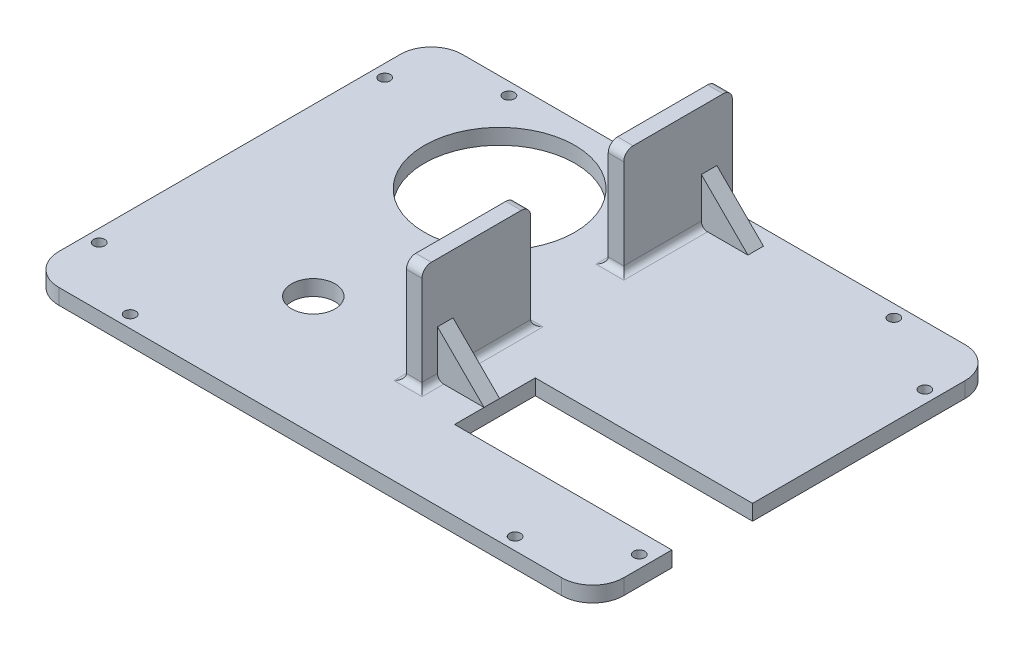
ISO-10303-21;
HEADER;
FILE_DESCRIPTION(('STEP AP214'),'2;1');
FILE_NAME('part.step','',(''),(''),'','','');
FILE_SCHEMA(('AUTOMOTIVE_DESIGN { 1 0 10303 214 1 1 1 1 }'));
ENDSEC;
DATA;
#1=APPLICATION_CONTEXT('core data for automotive mechanical design processes');
#2=APPLICATION_PROTOCOL_DEFINITION('international standard','automotive_design',2000,#1);
#3=PRODUCT_CONTEXT('',#1,'mechanical');
#4=PRODUCT('Part','Part','',(#3));
#5=PRODUCT_RELATED_PRODUCT_CATEGORY('part','',(#4));
#6=PRODUCT_DEFINITION_FORMATION('','',#4);
#7=PRODUCT_DEFINITION_CONTEXT('part definition',#1,'design');
#8=PRODUCT_DEFINITION('design','',#6,#7);
#9=PRODUCT_DEFINITION_SHAPE('','',#8);
#10=(LENGTH_UNIT() NAMED_UNIT(*) SI_UNIT(.MILLI.,.METRE.));
#11=(NAMED_UNIT(*) PLANE_ANGLE_UNIT() SI_UNIT($,.RADIAN.));
#12=(NAMED_UNIT(*) SI_UNIT($,.STERADIAN.) SOLID_ANGLE_UNIT());
#13=UNCERTAINTY_MEASURE_WITH_UNIT(LENGTH_MEASURE(1.E-05),#10,'distance_accuracy_value','');
#14=(GEOMETRIC_REPRESENTATION_CONTEXT(3) GLOBAL_UNCERTAINTY_ASSIGNED_CONTEXT((#13)) GLOBAL_UNIT_ASSIGNED_CONTEXT((#10,
#11,#12)) REPRESENTATION_CONTEXT('',''));
#15=CARTESIAN_POINT('',(0.,0.,0.));
#16=DIRECTION('',(0.,0.,1.));
#17=DIRECTION('',(1.,0.,0.));
#18=AXIS2_PLACEMENT_3D('',#15,#16,#17);
#19=CARTESIAN_POINT('',(58.5,5.,-1.5));
#20=DIRECTION('',(-0.707106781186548,-0.707106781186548,0.));
#21=DIRECTION('',(0.707106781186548,-0.707106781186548,0.));
#22=AXIS2_PLACEMENT_3D('',#19,#20,#21);
#23=PLANE('',#22);
#24=DIRECTION('',(0.707106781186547,-0.707106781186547,0.));
#25=VECTOR('',#24,1.);
#26=CARTESIAN_POINT('',(58.5,5.,3.5));
#27=LINE('',#26,#25);
#28=CARTESIAN_POINT('',(43.5,20.,3.50000000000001));
#29=VERTEX_POINT('',#28);
#30=CARTESIAN_POINT('',(58.5,5.,3.5));
#31=VERTEX_POINT('',#30);
#32=EDGE_CURVE('E98',#29,#31,#27,.T.);
#33=ORIENTED_EDGE('',*,*,#32,.T.);
#34=DIRECTION('',(0.,0.,1.));
#35=VECTOR('',#34,1.);
#36=CARTESIAN_POINT('',(58.5,5.,-1.5));
#37=LINE('',#36,#35);
#38=CARTESIAN_POINT('',(58.5,5.,-1.5));
#39=VERTEX_POINT('',#38);
#40=EDGE_CURVE('E12',#39,#31,#37,.T.);
#41=ORIENTED_EDGE('',*,*,#40,.F.);
#42=DIRECTION('',(0.707106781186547,-0.707106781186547,0.));
#43=VECTOR('',#42,1.);
#44=CARTESIAN_POINT('',(58.5,5.,-1.5));
#45=LINE('',#44,#43);
#46=CARTESIAN_POINT('',(43.5,20.,-1.49999999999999));
#47=VERTEX_POINT('',#46);
#48=EDGE_CURVE('E91',#47,#39,#45,.T.);
#49=ORIENTED_EDGE('',*,*,#48,.F.);
#50=DIRECTION('',(0.,0.,1.));
#51=VECTOR('',#50,1.);
#52=CARTESIAN_POINT('',(43.5,20.,-1.49999999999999));
#53=LINE('',#52,#51);
#54=EDGE_CURVE('E99',#47,#29,#53,.T.);
#55=ORIENTED_EDGE('',*,*,#54,.T.);
#56=EDGE_LOOP('',(#33,#41,#49,#55));
#57=FACE_BOUND('',#56,.T.);
#58=ADVANCED_FACE('F51',(#57),#23,.F.);
#59=CARTESIAN_POINT('',(43.5,5.,-1.49999999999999));
#60=DIRECTION('',(0.,1.,0.));
#61=DIRECTION('',(0.,0.,1.));
#62=AXIS2_PLACEMENT_3D('',#59,#60,#61);
#63=PLANE('',#62);
#64=DIRECTION('',(-1.,0.,0.));
#65=VECTOR('',#64,1.);
#66=CARTESIAN_POINT('',(43.5,5.,3.50000000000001));
#67=LINE('',#66,#65);
#68=CARTESIAN_POINT('',(43.5,5.,3.50000000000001));
#69=VERTEX_POINT('',#68);
#70=EDGE_CURVE('E79',#31,#69,#67,.T.);
#71=ORIENTED_EDGE('',*,*,#70,.T.);
#72=DIRECTION('',(0.,0.,1.));
#73=VECTOR('',#72,1.);
#74=CARTESIAN_POINT('',(43.5,5.,-1.49999999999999));
#75=LINE('',#74,#73);
#76=CARTESIAN_POINT('',(43.5,5.,-1.49999999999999));
#77=VERTEX_POINT('',#76);
#78=EDGE_CURVE('E59',#77,#69,#75,.T.);
#79=ORIENTED_EDGE('',*,*,#78,.F.);
#80=DIRECTION('',(-1.,0.,0.));
#81=VECTOR('',#80,1.);
#82=CARTESIAN_POINT('',(43.5,5.,-1.49999999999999));
#83=LINE('',#82,#81);
#84=EDGE_CURVE('E87',#39,#77,#83,.T.);
#85=ORIENTED_EDGE('',*,*,#84,.F.);
#86=ORIENTED_EDGE('',*,*,#40,.T.);
#87=EDGE_LOOP('',(#71,#79,#85,#86));
#88=FACE_BOUND('',#87,.T.);
#89=ADVANCED_FACE('F88',(#88),#63,.F.);
#90=CARTESIAN_POINT('',(43.5,5.,-1.49999999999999));
#91=DIRECTION('',(1.,0.,0.));
#92=DIRECTION('',(0.,0.,-1.));
#93=AXIS2_PLACEMENT_3D('',#90,#91,#92);
#94=PLANE('',#93);
#95=DIRECTION('',(0.,1.,0.));
#96=VECTOR('',#95,1.);
#97=CARTESIAN_POINT('',(43.5,5.,3.50000000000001));
#98=LINE('',#97,#96);
#99=EDGE_CURVE('E84',#69,#29,#98,.T.);
#100=ORIENTED_EDGE('',*,*,#99,.T.);
#101=ORIENTED_EDGE('',*,*,#54,.F.);
#102=DIRECTION('',(0.,1.,0.));
#103=VECTOR('',#102,1.);
#104=CARTESIAN_POINT('',(43.5,5.,-1.49999999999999));
#105=LINE('',#104,#103);
#106=EDGE_CURVE('E67',#77,#47,#105,.T.);
#107=ORIENTED_EDGE('',*,*,#106,.F.);
#108=ORIENTED_EDGE('',*,*,#78,.T.);
#109=EDGE_LOOP('',(#100,#101,#107,#108));
#110=FACE_BOUND('',#109,.T.);
#111=ADVANCED_FACE('F106',(#110),#94,.F.);
#112=CARTESIAN_POINT('',(0.,0.,-1.49999999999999));
#113=DIRECTION('',(0.,0.,-1.));
#114=DIRECTION('',(-1.,0.,0.));
#115=AXIS2_PLACEMENT_3D('',#112,#113,#114);
#116=PLANE('',#115);
#117=ORIENTED_EDGE('',*,*,#48,.T.);
#118=ORIENTED_EDGE('',*,*,#84,.T.);
#119=ORIENTED_EDGE('',*,*,#106,.T.);
#120=EDGE_LOOP('',(#117,#118,#119));
#121=FACE_BOUND('',#120,.T.);
#122=ADVANCED_FACE('F94',(#121),#116,.T.);
#123=CARTESIAN_POINT('',(0.,0.,3.50000000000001));
#124=DIRECTION('',(0.,0.,-1.));
#125=DIRECTION('',(-1.,0.,0.));
#126=AXIS2_PLACEMENT_3D('',#123,#124,#125);
#127=PLANE('',#126);
#128=ORIENTED_EDGE('',*,*,#32,.F.);
#129=ORIENTED_EDGE('',*,*,#99,.F.);
#130=ORIENTED_EDGE('',*,*,#70,.F.);
#131=EDGE_LOOP('',(#128,#129,#130));
#132=FACE_BOUND('',#131,.T.);
#133=ADVANCED_FACE('F107',(#132),#127,.F.);
#134=CLOSED_SHELL('',(#58,#89,#111,#122,#133));
#135=MANIFOLD_SOLID_BREP('B2',#134);
#136=CARTESIAN_POINT('',(43.5,20.,-81.5));
#137=DIRECTION('',(-0.707106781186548,-0.707106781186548,0.));
#138=DIRECTION('',(0.707106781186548,-0.707106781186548,0.));
#139=AXIS2_PLACEMENT_3D('',#136,#137,#138);
#140=PLANE('',#139);
#141=DIRECTION('',(-0.707106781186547,0.707106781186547,0.));
#142=VECTOR('',#141,1.);
#143=CARTESIAN_POINT('',(43.5,20.,-86.5));
#144=LINE('',#143,#142);
#145=CARTESIAN_POINT('',(58.5,5.,-86.5));
#146=VERTEX_POINT('',#145);
#147=CARTESIAN_POINT('',(43.5,20.,-86.5));
#148=VERTEX_POINT('',#147);
#149=EDGE_CURVE('E205',#146,#148,#144,.T.);
#150=ORIENTED_EDGE('',*,*,#149,.T.);
#151=DIRECTION('',(0.,0.,-1.));
#152=VECTOR('',#151,1.);
#153=CARTESIAN_POINT('',(43.5,20.,-81.5));
#154=LINE('',#153,#152);
#155=CARTESIAN_POINT('',(43.5,20.,-81.5));
#156=VERTEX_POINT('',#155);
#157=EDGE_CURVE('E49',#156,#148,#154,.T.);
#158=ORIENTED_EDGE('',*,*,#157,.F.);
#159=DIRECTION('',(-0.707106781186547,0.707106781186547,0.));
#160=VECTOR('',#159,1.);
#161=CARTESIAN_POINT('',(43.5,20.,-81.5));
#162=LINE('',#161,#160);
#163=CARTESIAN_POINT('',(58.5,5.,-81.5));
#164=VERTEX_POINT('',#163);
#165=EDGE_CURVE('E198',#164,#156,#162,.T.);
#166=ORIENTED_EDGE('',*,*,#165,.F.);
#167=DIRECTION('',(0.,0.,-1.));
#168=VECTOR('',#167,1.);
#169=CARTESIAN_POINT('',(58.5,5.,-81.5));
#170=LINE('',#169,#168);
#171=EDGE_CURVE('E206',#164,#146,#170,.T.);
#172=ORIENTED_EDGE('',*,*,#171,.T.);
#173=EDGE_LOOP('',(#150,#158,#166,#172));
#174=FACE_BOUND('',#173,.T.);
#175=ADVANCED_FACE('F158',(#174),#140,.F.);
#176=CARTESIAN_POINT('',(43.5,5.,-81.5));
#177=DIRECTION('',(1.,0.,0.));
#178=DIRECTION('',(0.,0.,-1.));
#179=AXIS2_PLACEMENT_3D('',#176,#177,#178);
#180=PLANE('',#179);
#181=DIRECTION('',(0.,-1.,0.));
#182=VECTOR('',#181,1.);
#183=CARTESIAN_POINT('',(43.5,5.,-86.5));
#184=LINE('',#183,#182);
#185=CARTESIAN_POINT('',(43.5,5.,-86.5));
#186=VERTEX_POINT('',#185);
#187=EDGE_CURVE('E186',#148,#186,#184,.T.);
#188=ORIENTED_EDGE('',*,*,#187,.T.);
#189=DIRECTION('',(0.,0.,-1.));
#190=VECTOR('',#189,1.);
#191=CARTESIAN_POINT('',(43.5,5.,-81.5));
#192=LINE('',#191,#190);
#193=CARTESIAN_POINT('',(43.5,5.,-81.5));
#194=VERTEX_POINT('',#193);
#195=EDGE_CURVE('E166',#194,#186,#192,.T.);
#196=ORIENTED_EDGE('',*,*,#195,.F.);
#197=DIRECTION('',(0.,-1.,0.));
#198=VECTOR('',#197,1.);
#199=CARTESIAN_POINT('',(43.5,5.,-81.5));
#200=LINE('',#199,#198);
#201=EDGE_CURVE('E194',#156,#194,#200,.T.);
#202=ORIENTED_EDGE('',*,*,#201,.F.);
#203=ORIENTED_EDGE('',*,*,#157,.T.);
#204=EDGE_LOOP('',(#188,#196,#202,#203));
#205=FACE_BOUND('',#204,.T.);
#206=ADVANCED_FACE('F195',(#205),#180,.F.);
#207=CARTESIAN_POINT('',(43.5,5.,-81.5));
#208=DIRECTION('',(0.,1.,0.));
#209=DIRECTION('',(0.,0.,1.));
#210=AXIS2_PLACEMENT_3D('',#207,#208,#209);
#211=PLANE('',#210);
#212=DIRECTION('',(1.,0.,0.));
#213=VECTOR('',#212,1.);
#214=CARTESIAN_POINT('',(43.5,5.,-86.5));
#215=LINE('',#214,#213);
#216=EDGE_CURVE('E191',#186,#146,#215,.T.);
#217=ORIENTED_EDGE('',*,*,#216,.T.);
#218=ORIENTED_EDGE('',*,*,#171,.F.);
#219=DIRECTION('',(1.,0.,0.));
#220=VECTOR('',#219,1.);
#221=CARTESIAN_POINT('',(43.5,5.,-81.5));
#222=LINE('',#221,#220);
#223=EDGE_CURVE('E174',#194,#164,#222,.T.);
#224=ORIENTED_EDGE('',*,*,#223,.F.);
#225=ORIENTED_EDGE('',*,*,#195,.T.);
#226=EDGE_LOOP('',(#217,#218,#224,#225));
#227=FACE_BOUND('',#226,.T.);
#228=ADVANCED_FACE('F213',(#227),#211,.F.);
#229=CARTESIAN_POINT('',(0.,0.,-81.5));
#230=DIRECTION('',(0.,0.,1.));
#231=DIRECTION('',(1.,0.,0.));
#232=AXIS2_PLACEMENT_3D('',#229,#230,#231);
#233=PLANE('',#232);
#234=ORIENTED_EDGE('',*,*,#165,.T.);
#235=ORIENTED_EDGE('',*,*,#201,.T.);
#236=ORIENTED_EDGE('',*,*,#223,.T.);
#237=EDGE_LOOP('',(#234,#235,#236));
#238=FACE_BOUND('',#237,.T.);
#239=ADVANCED_FACE('F201',(#238),#233,.T.);
#240=CARTESIAN_POINT('',(0.,0.,-86.5));
#241=DIRECTION('',(0.,0.,1.));
#242=DIRECTION('',(1.,0.,0.));
#243=AXIS2_PLACEMENT_3D('',#240,#241,#242);
#244=PLANE('',#243);
#245=ORIENTED_EDGE('',*,*,#149,.F.);
#246=ORIENTED_EDGE('',*,*,#216,.F.);
#247=ORIENTED_EDGE('',*,*,#187,.F.);
#248=EDGE_LOOP('',(#245,#246,#247));
#249=FACE_BOUND('',#248,.T.);
#250=ADVANCED_FACE('F214',(#249),#244,.F.);
#251=CLOSED_SHELL('',(#175,#206,#228,#239,#250));
#252=MANIFOLD_SOLID_BREP('B6',#251);
#253=CARTESIAN_POINT('',(23.5,5.,-16.5));
#254=DIRECTION('',(0.707106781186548,-0.707106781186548,0.));
#255=DIRECTION('',(0.707106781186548,0.707106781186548,0.));
#256=AXIS2_PLACEMENT_3D('',#253,#254,#255);
#257=PLANE('',#256);
#258=DIRECTION('',(-0.707106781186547,-0.707106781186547,0.));
#259=VECTOR('',#258,1.);
#260=CARTESIAN_POINT('',(23.5,5.,-21.5));
#261=LINE('',#260,#259);
#262=CARTESIAN_POINT('',(38.5,20.,-21.5));
#263=VERTEX_POINT('',#262);
#264=CARTESIAN_POINT('',(23.5,5.,-21.5));
#265=VERTEX_POINT('',#264);
#266=EDGE_CURVE('E312',#263,#265,#261,.T.);
#267=ORIENTED_EDGE('',*,*,#266,.T.);
#268=DIRECTION('',(0.,0.,-1.));
#269=VECTOR('',#268,1.);
#270=CARTESIAN_POINT('',(23.5,5.,-16.5));
#271=LINE('',#270,#269);
#272=CARTESIAN_POINT('',(23.5,5.,-16.5));
#273=VERTEX_POINT('',#272);
#274=EDGE_CURVE('E156',#273,#265,#271,.T.);
#275=ORIENTED_EDGE('',*,*,#274,.F.);
#276=DIRECTION('',(-0.707106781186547,-0.707106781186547,0.));
#277=VECTOR('',#276,1.);
#278=CARTESIAN_POINT('',(23.5,5.,-16.5));
#279=LINE('',#278,#277);
#280=CARTESIAN_POINT('',(38.5,20.,-16.5));
#281=VERTEX_POINT('',#280);
#282=EDGE_CURVE('E305',#281,#273,#279,.T.);
#283=ORIENTED_EDGE('',*,*,#282,.F.);
#284=DIRECTION('',(0.,0.,-1.));
#285=VECTOR('',#284,1.);
#286=CARTESIAN_POINT('',(38.5,20.,-16.5));
#287=LINE('',#286,#285);
#288=EDGE_CURVE('E313',#281,#263,#287,.T.);
#289=ORIENTED_EDGE('',*,*,#288,.T.);
#290=EDGE_LOOP('',(#267,#275,#283,#289));
#291=FACE_BOUND('',#290,.T.);
#292=ADVANCED_FACE('F265',(#291),#257,.F.);
#293=CARTESIAN_POINT('',(38.5,5.,-16.5));
#294=DIRECTION('',(0.,1.,0.));
#295=DIRECTION('',(0.,0.,1.));
#296=AXIS2_PLACEMENT_3D('',#293,#294,#295);
#297=PLANE('',#296);
#298=DIRECTION('',(1.,0.,0.));
#299=VECTOR('',#298,1.);
#300=CARTESIAN_POINT('',(38.5,5.,-21.5));
#301=LINE('',#300,#299);
#302=CARTESIAN_POINT('',(38.5,5.,-21.5));
#303=VERTEX_POINT('',#302);
#304=EDGE_CURVE('E293',#265,#303,#301,.T.);
#305=ORIENTED_EDGE('',*,*,#304,.T.);
#306=DIRECTION('',(0.,0.,-1.));
#307=VECTOR('',#306,1.);
#308=CARTESIAN_POINT('',(38.5,5.,-16.5));
#309=LINE('',#308,#307);
#310=CARTESIAN_POINT('',(38.5,5.,-16.5));
#311=VERTEX_POINT('',#310);
#312=EDGE_CURVE('E273',#311,#303,#309,.T.);
#313=ORIENTED_EDGE('',*,*,#312,.F.);
#314=DIRECTION('',(1.,0.,0.));
#315=VECTOR('',#314,1.);
#316=CARTESIAN_POINT('',(38.5,5.,-16.5));
#317=LINE('',#316,#315);
#318=EDGE_CURVE('E301',#273,#311,#317,.T.);
#319=ORIENTED_EDGE('',*,*,#318,.F.);
#320=ORIENTED_EDGE('',*,*,#274,.T.);
#321=EDGE_LOOP('',(#305,#313,#319,#320));
#322=FACE_BOUND('',#321,.T.);
#323=ADVANCED_FACE('F302',(#322),#297,.F.);
#324=CARTESIAN_POINT('',(38.5,5.,-16.5));
#325=DIRECTION('',(-1.,0.,0.));
#326=DIRECTION('',(0.,0.,1.));
#327=AXIS2_PLACEMENT_3D('',#324,#325,#326);
#328=PLANE('',#327);
#329=DIRECTION('',(0.,1.,0.));
#330=VECTOR('',#329,1.);
#331=CARTESIAN_POINT('',(38.5,5.,-21.5));
#332=LINE('',#331,#330);
#333=EDGE_CURVE('E298',#303,#263,#332,.T.);
#334=ORIENTED_EDGE('',*,*,#333,.T.);
#335=ORIENTED_EDGE('',*,*,#288,.F.);
#336=DIRECTION('',(0.,1.,0.));
#337=VECTOR('',#336,1.);
#338=CARTESIAN_POINT('',(38.5,5.,-16.5));
#339=LINE('',#338,#337);
#340=EDGE_CURVE('E281',#311,#281,#339,.T.);
#341=ORIENTED_EDGE('',*,*,#340,.F.);
#342=ORIENTED_EDGE('',*,*,#312,.T.);
#343=EDGE_LOOP('',(#334,#335,#341,#342));
#344=FACE_BOUND('',#343,.T.);
#345=ADVANCED_FACE('F320',(#344),#328,.F.);
#346=CARTESIAN_POINT('',(0.,0.,-16.5));
#347=DIRECTION('',(0.,0.,1.));
#348=DIRECTION('',(1.,0.,0.));
#349=AXIS2_PLACEMENT_3D('',#346,#347,#348);
#350=PLANE('',#349);
#351=ORIENTED_EDGE('',*,*,#282,.T.);
#352=ORIENTED_EDGE('',*,*,#318,.T.);
#353=ORIENTED_EDGE('',*,*,#340,.T.);
#354=EDGE_LOOP('',(#351,#352,#353));
#355=FACE_BOUND('',#354,.T.);
#356=ADVANCED_FACE('F308',(#355),#350,.T.);
#357=CARTESIAN_POINT('',(0.,0.,-21.5));
#358=DIRECTION('',(0.,0.,1.));
#359=DIRECTION('',(1.,0.,0.));
#360=AXIS2_PLACEMENT_3D('',#357,#358,#359);
#361=PLANE('',#360);
#362=ORIENTED_EDGE('',*,*,#266,.F.);
#363=ORIENTED_EDGE('',*,*,#333,.F.);
#364=ORIENTED_EDGE('',*,*,#304,.F.);
#365=EDGE_LOOP('',(#362,#363,#364));
#366=FACE_BOUND('',#365,.T.);
#367=ADVANCED_FACE('F321',(#366),#361,.F.);
#368=CLOSED_SHELL('',(#292,#323,#345,#356,#367));
#369=MANIFOLD_SOLID_BREP('B43',#368);
#370=CARTESIAN_POINT('',(23.5,5.,-76.5));
#371=DIRECTION('',(0.707106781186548,-0.707106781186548,0.));
#372=DIRECTION('',(0.707106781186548,0.707106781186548,0.));
#373=AXIS2_PLACEMENT_3D('',#370,#371,#372);
#374=PLANE('',#373);
#375=DIRECTION('',(0.707106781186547,0.707106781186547,0.));
#376=VECTOR('',#375,1.);
#377=CARTESIAN_POINT('',(23.5,5.,-71.5));
#378=LINE('',#377,#376);
#379=CARTESIAN_POINT('',(23.5,5.,-71.5));
#380=VERTEX_POINT('',#379);
#381=CARTESIAN_POINT('',(38.5,20.,-71.5));
#382=VERTEX_POINT('',#381);
#383=EDGE_CURVE('E419',#380,#382,#378,.T.);
#384=ORIENTED_EDGE('',*,*,#383,.T.);
#385=DIRECTION('',(0.,0.,1.));
#386=VECTOR('',#385,1.);
#387=CARTESIAN_POINT('',(38.5,20.,-76.5));
#388=LINE('',#387,#386);
#389=CARTESIAN_POINT('',(38.5,20.,-76.5));
#390=VERTEX_POINT('',#389);
#391=EDGE_CURVE('E263',#390,#382,#388,.T.);
#392=ORIENTED_EDGE('',*,*,#391,.F.);
#393=DIRECTION('',(0.707106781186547,0.707106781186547,0.));
#394=VECTOR('',#393,1.);
#395=CARTESIAN_POINT('',(23.5,5.,-76.5));
#396=LINE('',#395,#394);
#397=CARTESIAN_POINT('',(23.5,5.,-76.5));
#398=VERTEX_POINT('',#397);
#399=EDGE_CURVE('E412',#398,#390,#396,.T.);
#400=ORIENTED_EDGE('',*,*,#399,.F.);
#401=DIRECTION('',(0.,0.,1.));
#402=VECTOR('',#401,1.);
#403=CARTESIAN_POINT('',(23.5,5.,-76.5));
#404=LINE('',#403,#402);
#405=EDGE_CURVE('E420',#398,#380,#404,.T.);
#406=ORIENTED_EDGE('',*,*,#405,.T.);
#407=EDGE_LOOP('',(#384,#392,#400,#406));
#408=FACE_BOUND('',#407,.T.);
#409=ADVANCED_FACE('F372',(#408),#374,.F.);
#410=CARTESIAN_POINT('',(38.5,5.,-76.5));
#411=DIRECTION('',(-1.,0.,0.));
#412=DIRECTION('',(0.,0.,1.));
#413=AXIS2_PLACEMENT_3D('',#410,#411,#412);
#414=PLANE('',#413);
#415=DIRECTION('',(0.,-1.,0.));
#416=VECTOR('',#415,1.);
#417=CARTESIAN_POINT('',(38.5,5.,-71.5));
#418=LINE('',#417,#416);
#419=CARTESIAN_POINT('',(38.5,5.,-71.5));
#420=VERTEX_POINT('',#419);
#421=EDGE_CURVE('E400',#382,#420,#418,.T.);
#422=ORIENTED_EDGE('',*,*,#421,.T.);
#423=DIRECTION('',(0.,0.,1.));
#424=VECTOR('',#423,1.);
#425=CARTESIAN_POINT('',(38.5,5.,-76.5));
#426=LINE('',#425,#424);
#427=CARTESIAN_POINT('',(38.5,5.,-76.5));
#428=VERTEX_POINT('',#427);
#429=EDGE_CURVE('E380',#428,#420,#426,.T.);
#430=ORIENTED_EDGE('',*,*,#429,.F.);
#431=DIRECTION('',(0.,-1.,0.));
#432=VECTOR('',#431,1.);
#433=CARTESIAN_POINT('',(38.5,5.,-76.5));
#434=LINE('',#433,#432);
#435=EDGE_CURVE('E408',#390,#428,#434,.T.);
#436=ORIENTED_EDGE('',*,*,#435,.F.);
#437=ORIENTED_EDGE('',*,*,#391,.T.);
#438=EDGE_LOOP('',(#422,#430,#436,#437));
#439=FACE_BOUND('',#438,.T.);
#440=ADVANCED_FACE('F409',(#439),#414,.F.);
#441=CARTESIAN_POINT('',(38.5,5.,-76.5));
#442=DIRECTION('',(0.,1.,0.));
#443=DIRECTION('',(0.,0.,1.));
#444=AXIS2_PLACEMENT_3D('',#441,#442,#443);
#445=PLANE('',#444);
#446=DIRECTION('',(-1.,0.,0.));
#447=VECTOR('',#446,1.);
#448=CARTESIAN_POINT('',(38.5,5.,-71.5));
#449=LINE('',#448,#447);
#450=EDGE_CURVE('E405',#420,#380,#449,.T.);
#451=ORIENTED_EDGE('',*,*,#450,.T.);
#452=ORIENTED_EDGE('',*,*,#405,.F.);
#453=DIRECTION('',(-1.,0.,0.));
#454=VECTOR('',#453,1.);
#455=CARTESIAN_POINT('',(38.5,5.,-76.5));
#456=LINE('',#455,#454);
#457=EDGE_CURVE('E388',#428,#398,#456,.T.);
#458=ORIENTED_EDGE('',*,*,#457,.F.);
#459=ORIENTED_EDGE('',*,*,#429,.T.);
#460=EDGE_LOOP('',(#451,#452,#458,#459));
#461=FACE_BOUND('',#460,.T.);
#462=ADVANCED_FACE('F427',(#461),#445,.F.);
#463=CARTESIAN_POINT('',(0.,0.,-76.5));
#464=DIRECTION('',(0.,0.,1.));
#465=DIRECTION('',(1.,0.,0.));
#466=AXIS2_PLACEMENT_3D('',#463,#464,#465);
#467=PLANE('',#466);
#468=ORIENTED_EDGE('',*,*,#399,.T.);
#469=ORIENTED_EDGE('',*,*,#435,.T.);
#470=ORIENTED_EDGE('',*,*,#457,.T.);
#471=EDGE_LOOP('',(#468,#469,#470));
#472=FACE_BOUND('',#471,.T.);
#473=ADVANCED_FACE('F415',(#472),#467,.F.);
#474=CARTESIAN_POINT('',(0.,0.,-71.5));
#475=DIRECTION('',(0.,0.,1.));
#476=DIRECTION('',(1.,0.,0.));
#477=AXIS2_PLACEMENT_3D('',#474,#475,#476);
#478=PLANE('',#477);
#479=ORIENTED_EDGE('',*,*,#383,.F.);
#480=ORIENTED_EDGE('',*,*,#450,.F.);
#481=ORIENTED_EDGE('',*,*,#421,.F.);
#482=EDGE_LOOP('',(#479,#480,#481));
#483=FACE_BOUND('',#482,.T.);
#484=ADVANCED_FACE('F428',(#483),#478,.T.);
#485=CLOSED_SHELL('',(#409,#440,#462,#473,#484));
#486=MANIFOLD_SOLID_BREP('B150',#485);
#487=CARTESIAN_POINT('',(0.,5.,0.));
#488=DIRECTION('',(0.,1.,0.));
#489=DIRECTION('',(0.,0.,1.));
#490=AXIS2_PLACEMENT_3D('',#487,#488,#489);
#491=PLANE('',#490);
#492=CARTESIAN_POINT('',(-24.5,5.,34.5));
#493=DIRECTION('',(0.,1.,0.));
#494=DIRECTION('',(0.,0.,1.));
#495=AXIS2_PLACEMENT_3D('',#492,#493,#494);
#496=CIRCLE('',#495,1.8);
#497=CARTESIAN_POINT('',(-24.5,5.,36.3));
#498=VERTEX_POINT('',#497);
#499=EDGE_CURVE('E1417',#498,#498,#496,.T.);
#500=ORIENTED_EDGE('',*,*,#499,.F.);
#501=EDGE_LOOP('',(#500));
#502=FACE_BOUND('',#501,.T.);
#503=CARTESIAN_POINT('',(99.5,5.,34.5));
#504=DIRECTION('',(0.,1.,0.));
#505=DIRECTION('',(0.,0.,-1.));
#506=AXIS2_PLACEMENT_3D('',#503,#504,#505);
#507=CIRCLE('',#506,1.79999999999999);
#508=CARTESIAN_POINT('',(99.5,5.,32.7));
#509=VERTEX_POINT('',#508);
#510=EDGE_CURVE('E1409',#509,#509,#507,.T.);
#511=ORIENTED_EDGE('',*,*,#510,.F.);
#512=EDGE_LOOP('',(#511));
#513=FACE_BOUND('',#512,.T.);
#514=CARTESIAN_POINT('',(124.5,5.,19.5));
#515=DIRECTION('',(0.,1.,0.));
#516=DIRECTION('',(0.,0.,-1.));
#517=AXIS2_PLACEMENT_3D('',#514,#515,#516);
#518=CIRCLE('',#517,1.80000000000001);
#519=CARTESIAN_POINT('',(124.5,5.,17.7));
#520=VERTEX_POINT('',#519);
#521=EDGE_CURVE('E1401',#520,#520,#518,.T.);
#522=ORIENTED_EDGE('',*,*,#521,.F.);
#523=EDGE_LOOP('',(#522));
#524=FACE_BOUND('',#523,.T.);
#525=CARTESIAN_POINT('',(124.5,5.,-72.5));
#526=DIRECTION('',(0.,1.,0.));
#527=DIRECTION('',(0.,0.,1.));
#528=AXIS2_PLACEMENT_3D('',#525,#526,#527);
#529=CIRCLE('',#528,1.80000000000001);
#530=CARTESIAN_POINT('',(124.5,5.,-70.7));
#531=VERTEX_POINT('',#530);
#532=EDGE_CURVE('E1392',#531,#531,#529,.T.);
#533=ORIENTED_EDGE('',*,*,#532,.F.);
#534=EDGE_LOOP('',(#533));
#535=FACE_BOUND('',#534,.T.);
#536=CARTESIAN_POINT('',(99.5,5.,-87.5));
#537=DIRECTION('',(0.,1.,0.));
#538=DIRECTION('',(0.,0.,1.));
#539=AXIS2_PLACEMENT_3D('',#536,#537,#538);
#540=CIRCLE('',#539,1.79999999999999);
#541=CARTESIAN_POINT('',(99.5,5.,-85.7));
#542=VERTEX_POINT('',#541);
#543=EDGE_CURVE('E1440',#542,#542,#540,.T.);
#544=ORIENTED_EDGE('',*,*,#543,.F.);
#545=EDGE_LOOP('',(#544));
#546=FACE_BOUND('',#545,.T.);
#547=CARTESIAN_POINT('',(-24.5,5.,-87.5));
#548=DIRECTION('',(0.,1.,0.));
#549=DIRECTION('',(0.,0.,-1.));
#550=AXIS2_PLACEMENT_3D('',#547,#548,#549);
#551=CIRCLE('',#550,1.8);
#552=CARTESIAN_POINT('',(-24.5,5.,-89.3));
#553=VERTEX_POINT('',#552);
#554=EDGE_CURVE('E1432',#553,#553,#551,.T.);
#555=ORIENTED_EDGE('',*,*,#554,.F.);
#556=EDGE_LOOP('',(#555));
#557=FACE_BOUND('',#556,.T.);
#558=CARTESIAN_POINT('',(-49.5,5.,-72.5));
#559=DIRECTION('',(0.,1.,0.));
#560=DIRECTION('',(0.,0.,-1.));
#561=AXIS2_PLACEMENT_3D('',#558,#559,#560);
#562=CIRCLE('',#561,1.8);
#563=CARTESIAN_POINT('',(-49.5,5.,-74.3));
#564=VERTEX_POINT('',#563);
#565=EDGE_CURVE('E1424',#564,#564,#562,.T.);
#566=ORIENTED_EDGE('',*,*,#565,.F.);
#567=EDGE_LOOP('',(#566));
#568=FACE_BOUND('',#567,.T.);
#569=CARTESIAN_POINT('',(-49.5,5.,19.5));
#570=DIRECTION('',(0.,1.,0.));
#571=DIRECTION('',(0.,0.,1.));
#572=AXIS2_PLACEMENT_3D('',#569,#570,#571);
#573=CIRCLE('',#572,1.8);
#574=CARTESIAN_POINT('',(-49.5,5.,21.3));
#575=VERTEX_POINT('',#574);
#576=EDGE_CURVE('E1384',#575,#575,#573,.T.);
#577=ORIENTED_EDGE('',*,*,#576,.F.);
#578=EDGE_LOOP('',(#577));
#579=FACE_BOUND('',#578,.T.);
#580=DIRECTION('',(0.,0.,1.));
#581=VECTOR('',#580,1.);
#582=CARTESIAN_POINT('',(36.5,5.,0.));
#583=LINE('',#582,#581);
#584=CARTESIAN_POINT('',(36.5,5.,10.5));
#585=VERTEX_POINT('',#584);
#586=CARTESIAN_POINT('',(36.5,5.,-28.5));
#587=VERTEX_POINT('',#586);
#588=EDGE_CURVE('E702',#585,#587,#583,.F.);
#589=ORIENTED_EDGE('',*,*,#588,.T.);
#590=DIRECTION('',(-1.,0.,0.));
#591=VECTOR('',#590,1.);
#592=CARTESIAN_POINT('',(0.,5.,-28.5));
#593=LINE('',#592,#591);
#594=CARTESIAN_POINT('',(45.5,5.,-28.5));
#595=VERTEX_POINT('',#594);
#596=EDGE_CURVE('E705',#587,#595,#593,.F.);
#597=ORIENTED_EDGE('',*,*,#596,.T.);
#598=DIRECTION('',(0.,0.,-1.));
#599=VECTOR('',#598,1.);
#600=CARTESIAN_POINT('',(45.5,5.,0.));
#601=LINE('',#600,#599);
#602=CARTESIAN_POINT('',(45.5,5.,10.5));
#603=VERTEX_POINT('',#602);
#604=EDGE_CURVE('E691',#595,#603,#601,.F.);
#605=ORIENTED_EDGE('',*,*,#604,.T.);
#606=DIRECTION('',(1.,0.,0.));
#607=VECTOR('',#606,1.);
#608=CARTESIAN_POINT('',(0.,5.,10.5));
#609=LINE('',#608,#607);
#610=EDGE_CURVE('E699',#603,#585,#609,.F.);
#611=ORIENTED_EDGE('',*,*,#610,.T.);
#612=EDGE_LOOP('',(#589,#597,#605,#611));
#613=FACE_BOUND('',#612,.T.);
#614=DIRECTION('',(1.,0.,0.));
#615=VECTOR('',#614,1.);
#616=CARTESIAN_POINT('',(0.,5.,-54.5));
#617=LINE('',#616,#615);
#618=CARTESIAN_POINT('',(45.5,5.,-54.5));
#619=VERTEX_POINT('',#618);
#620=CARTESIAN_POINT('',(36.5,5.,-54.5));
#621=VERTEX_POINT('',#620);
#622=EDGE_CURVE('E712',#619,#621,#617,.F.);
#623=ORIENTED_EDGE('',*,*,#622,.T.);
#624=DIRECTION('',(0.,0.,1.));
#625=VECTOR('',#624,1.);
#626=CARTESIAN_POINT('',(36.5,5.,0.));
#627=LINE('',#626,#625);
#628=CARTESIAN_POINT('',(36.5,5.,-91.5));
#629=VERTEX_POINT('',#628);
#630=EDGE_CURVE('E715',#621,#629,#627,.F.);
#631=ORIENTED_EDGE('',*,*,#630,.T.);
#632=DIRECTION('',(1.,0.,0.));
#633=VECTOR('',#632,1.);
#634=CARTESIAN_POINT('',(0.,5.,-91.5));
#635=LINE('',#634,#633);
#636=CARTESIAN_POINT('',(-43.5,5.,-91.5));
#637=VERTEX_POINT('',#636);
#638=EDGE_CURVE('E907',#637,#629,#635,.T.);
#639=ORIENTED_EDGE('',*,*,#638,.F.);
#640=CARTESIAN_POINT('',(-43.5,5.,-81.5));
#641=DIRECTION('',(0.,1.,0.));
#642=DIRECTION('',(0.,0.,1.));
#643=AXIS2_PLACEMENT_3D('',#640,#641,#642);
#644=CIRCLE('',#643,10.);
#645=CARTESIAN_POINT('',(-53.5,5.,-81.5));
#646=VERTEX_POINT('',#645);
#647=EDGE_CURVE('E675',#637,#646,#644,.T.);
#648=ORIENTED_EDGE('',*,*,#647,.T.);
#649=DIRECTION('',(0.,0.,1.));
#650=VECTOR('',#649,1.);
#651=CARTESIAN_POINT('',(-53.5,5.,0.));
#652=LINE('',#651,#650);
#653=CARTESIAN_POINT('',(-53.5,5.,28.5));
#654=VERTEX_POINT('',#653);
#655=EDGE_CURVE('E669',#646,#654,#652,.T.);
#656=ORIENTED_EDGE('',*,*,#655,.T.);
#657=CARTESIAN_POINT('',(-43.5,5.,28.5));
#658=DIRECTION('',(0.,1.,0.));
#659=DIRECTION('',(0.,0.,1.));
#660=AXIS2_PLACEMENT_3D('',#657,#658,#659);
#661=CIRCLE('',#660,9.99999999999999);
#662=CARTESIAN_POINT('',(-43.5,5.,38.5));
#663=VERTEX_POINT('',#662);
#664=EDGE_CURVE('E657',#654,#663,#661,.T.);
#665=ORIENTED_EDGE('',*,*,#664,.T.);
#666=DIRECTION('',(1.,0.,0.));
#667=VECTOR('',#666,1.);
#668=CARTESIAN_POINT('',(0.,5.,38.5));
#669=LINE('',#668,#667);
#670=CARTESIAN_POINT('',(118.5,5.,38.5));
#671=VERTEX_POINT('',#670);
#672=EDGE_CURVE('E668',#663,#671,#669,.T.);
#673=ORIENTED_EDGE('',*,*,#672,.T.);
#674=CARTESIAN_POINT('',(118.5,5.,28.5));
#675=DIRECTION('',(0.,1.,0.));
#676=DIRECTION('',(0.,0.,1.));
#677=AXIS2_PLACEMENT_3D('',#674,#675,#676);
#678=CIRCLE('',#677,9.99999999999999);
#679=CARTESIAN_POINT('',(128.5,5.,28.5));
#680=VERTEX_POINT('',#679);
#681=EDGE_CURVE('E882',#671,#680,#678,.T.);
#682=ORIENTED_EDGE('',*,*,#681,.T.);
#683=DIRECTION('',(0.,0.,1.));
#684=VECTOR('',#683,1.);
#685=CARTESIAN_POINT('',(128.5,5.,0.));
#686=LINE('',#685,#684);
#687=CARTESIAN_POINT('',(128.5,5.,13.));
#688=VERTEX_POINT('',#687);
#689=EDGE_CURVE('E885',#688,#680,#686,.T.);
#690=ORIENTED_EDGE('',*,*,#689,.F.);
#691=DIRECTION('',(1.,0.,0.));
#692=VECTOR('',#691,1.);
#693=CARTESIAN_POINT('',(0.,5.,13.));
#694=LINE('',#693,#692);
#695=CARTESIAN_POINT('',(58.5,5.,13.));
#696=VERTEX_POINT('',#695);
#697=EDGE_CURVE('E889',#696,#688,#694,.T.);
#698=ORIENTED_EDGE('',*,*,#697,.F.);
#699=DIRECTION('',(0.,0.,1.));
#700=VECTOR('',#699,1.);
#701=CARTESIAN_POINT('',(58.5,5.,0.));
#702=LINE('',#701,#700);
#703=CARTESIAN_POINT('',(58.5,5.,-13.));
#704=VERTEX_POINT('',#703);
#705=EDGE_CURVE('E894',#704,#696,#702,.T.);
#706=ORIENTED_EDGE('',*,*,#705,.F.);
#707=DIRECTION('',(-1.,0.,0.));
#708=VECTOR('',#707,1.);
#709=CARTESIAN_POINT('',(0.,5.,-13.));
#710=LINE('',#709,#708);
#711=CARTESIAN_POINT('',(128.5,5.,-13.));
#712=VERTEX_POINT('',#711);
#713=EDGE_CURVE('E898',#712,#704,#710,.T.);
#714=ORIENTED_EDGE('',*,*,#713,.F.);
#715=CARTESIAN_POINT('',(128.5,5.,-81.5));
#716=VERTEX_POINT('',#715);
#717=EDGE_CURVE('E890',#716,#712,#686,.T.);
#718=ORIENTED_EDGE('',*,*,#717,.F.);
#719=CARTESIAN_POINT('',(118.5,5.,-81.5));
#720=DIRECTION('',(0.,1.,0.));
#721=DIRECTION('',(0.,0.,1.));
#722=AXIS2_PLACEMENT_3D('',#719,#720,#721);
#723=CIRCLE('',#722,9.99999999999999);
#724=CARTESIAN_POINT('',(118.5,5.,-91.5));
#725=VERTEX_POINT('',#724);
#726=EDGE_CURVE('E902',#725,#716,#723,.F.);
#727=ORIENTED_EDGE('',*,*,#726,.F.);
#728=CARTESIAN_POINT('',(45.5,5.,-91.5));
#729=VERTEX_POINT('',#728);
#730=EDGE_CURVE('E906',#729,#725,#635,.T.);
#731=ORIENTED_EDGE('',*,*,#730,.F.);
#732=DIRECTION('',(0.,0.,-1.));
#733=VECTOR('',#732,1.);
#734=CARTESIAN_POINT('',(45.5,5.,0.));
#735=LINE('',#734,#733);
#736=EDGE_CURVE('E709',#729,#619,#735,.F.);
#737=ORIENTED_EDGE('',*,*,#736,.T.);
#738=EDGE_LOOP('',(#623,#631,#639,#648,#656,#665,#673,#682,#690,#698,#706,#714,#718,#727,#731,#737));
#739=FACE_BOUND('',#738,.T.);
#740=CARTESIAN_POINT('',(0.,5.,-60.));
#741=DIRECTION('',(0.,1.,0.));
#742=DIRECTION('',(0.,0.,1.));
#743=AXIS2_PLACEMENT_3D('',#740,#741,#742);
#744=CIRCLE('',#743,24.25);
#745=CARTESIAN_POINT('',(0.,5.,-35.75));
#746=VERTEX_POINT('',#745);
#747=EDGE_CURVE('E872',#746,#746,#744,.T.);
#748=ORIENTED_EDGE('',*,*,#747,.F.);
#749=EDGE_LOOP('',(#748));
#750=FACE_BOUND('',#749,.T.);
#751=CARTESIAN_POINT('',(0.,5.,0.));
#752=DIRECTION('',(0.,1.,0.));
#753=DIRECTION('',(0.,0.,1.));
#754=AXIS2_PLACEMENT_3D('',#751,#752,#753);
#755=CIRCLE('',#754,7.);
#756=CARTESIAN_POINT('',(0.,5.,7.));
#757=VERTEX_POINT('',#756);
#758=EDGE_CURVE('E680',#757,#757,#755,.T.);
#759=ORIENTED_EDGE('',*,*,#758,.F.);
#760=EDGE_LOOP('',(#759));
#761=FACE_BOUND('',#760,.T.);
#762=ADVANCED_FACE('F471',(#502,#513,#524,#535,#546,#557,#568,#579,#613,#739,#750,#761),#491,.T.);
#763=CARTESIAN_POINT('',(-53.5,5.,0.));
#764=DIRECTION('',(1.,0.,0.));
#765=DIRECTION('',(0.,0.,-1.));
#766=AXIS2_PLACEMENT_3D('',#763,#764,#765);
#767=PLANE('',#766);
#768=DIRECTION('',(0.,0.,1.));
#769=VECTOR('',#768,1.);
#770=CARTESIAN_POINT('',(-53.5,0.,0.));
#771=LINE('',#770,#769);
#772=CARTESIAN_POINT('',(-53.5,0.,-81.5));
#773=VERTEX_POINT('',#772);
#774=CARTESIAN_POINT('',(-53.5,0.,28.5));
#775=VERTEX_POINT('',#774);
#776=EDGE_CURVE('E684',#773,#775,#771,.T.);
#777=ORIENTED_EDGE('',*,*,#776,.T.);
#778=DIRECTION('',(0.,-1.,0.));
#779=VECTOR('',#778,1.);
#780=CARTESIAN_POINT('',(-53.5,5.,28.5));
#781=LINE('',#780,#779);
#782=EDGE_CURVE('E661',#654,#775,#781,.T.);
#783=ORIENTED_EDGE('',*,*,#782,.F.);
#784=ORIENTED_EDGE('',*,*,#655,.F.);
#785=DIRECTION('',(0.,-1.,0.));
#786=VECTOR('',#785,1.);
#787=CARTESIAN_POINT('',(-53.5,5.,-81.5));
#788=LINE('',#787,#786);
#789=EDGE_CURVE('E913',#646,#773,#788,.T.);
#790=ORIENTED_EDGE('',*,*,#789,.T.);
#791=EDGE_LOOP('',(#777,#783,#784,#790));
#792=FACE_BOUND('',#791,.T.);
#793=ADVANCED_FACE('F682',(#792),#767,.F.);
#794=CARTESIAN_POINT('',(-43.5,5.,28.5));
#795=DIRECTION('',(0.,-1.,0.));
#796=DIRECTION('',(0.,0.,-1.));
#797=AXIS2_PLACEMENT_3D('',#794,#795,#796);
#798=CYLINDRICAL_SURFACE('',#797,9.99999999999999);
#799=CARTESIAN_POINT('',(-43.5,0.,28.5));
#800=DIRECTION('',(0.,1.,0.));
#801=DIRECTION('',(0.,0.,1.));
#802=AXIS2_PLACEMENT_3D('',#799,#800,#801);
#803=CIRCLE('',#802,9.99999999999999);
#804=CARTESIAN_POINT('',(-43.5,0.,38.5));
#805=VERTEX_POINT('',#804);
#806=EDGE_CURVE('E923',#775,#805,#803,.T.);
#807=ORIENTED_EDGE('',*,*,#806,.T.);
#808=DIRECTION('',(0.,-1.,0.));
#809=VECTOR('',#808,1.);
#810=CARTESIAN_POINT('',(-43.5,5.,38.5));
#811=LINE('',#810,#809);
#812=EDGE_CURVE('E664',#663,#805,#811,.T.);
#813=ORIENTED_EDGE('',*,*,#812,.F.);
#814=ORIENTED_EDGE('',*,*,#664,.F.);
#815=ORIENTED_EDGE('',*,*,#782,.T.);
#816=EDGE_LOOP('',(#807,#813,#814,#815));
#817=FACE_BOUND('',#816,.T.);
#818=ADVANCED_FACE('F659',(#817),#798,.T.);
#819=CARTESIAN_POINT('',(0.,5.,38.5));
#820=DIRECTION('',(0.,0.,-1.));
#821=DIRECTION('',(-1.,0.,0.));
#822=AXIS2_PLACEMENT_3D('',#819,#820,#821);
#823=PLANE('',#822);
#824=DIRECTION('',(1.,0.,0.));
#825=VECTOR('',#824,1.);
#826=CARTESIAN_POINT('',(0.,0.,38.5));
#827=LINE('',#826,#825);
#828=CARTESIAN_POINT('',(118.5,0.,38.5));
#829=VERTEX_POINT('',#828);
#830=EDGE_CURVE('E926',#805,#829,#827,.T.);
#831=ORIENTED_EDGE('',*,*,#830,.T.);
#832=DIRECTION('',(0.,-1.,0.));
#833=VECTOR('',#832,1.);
#834=CARTESIAN_POINT('',(118.5,5.,38.5));
#835=LINE('',#834,#833);
#836=EDGE_CURVE('E693',#671,#829,#835,.T.);
#837=ORIENTED_EDGE('',*,*,#836,.F.);
#838=ORIENTED_EDGE('',*,*,#672,.F.);
#839=ORIENTED_EDGE('',*,*,#812,.T.);
#840=EDGE_LOOP('',(#831,#837,#838,#839));
#841=FACE_BOUND('',#840,.T.);
#842=ADVANCED_FACE('F1052',(#841),#823,.F.);
#843=CARTESIAN_POINT('',(118.5,5.,28.5));
#844=DIRECTION('',(0.,-1.,0.));
#845=DIRECTION('',(0.,0.,-1.));
#846=AXIS2_PLACEMENT_3D('',#843,#844,#845);
#847=CYLINDRICAL_SURFACE('',#846,9.99999999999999);
#848=CARTESIAN_POINT('',(118.5,0.,28.5));
#849=DIRECTION('',(0.,1.,0.));
#850=DIRECTION('',(0.,0.,1.));
#851=AXIS2_PLACEMENT_3D('',#848,#849,#850);
#852=CIRCLE('',#851,9.99999999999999);
#853=CARTESIAN_POINT('',(128.5,0.,28.5));
#854=VERTEX_POINT('',#853);
#855=EDGE_CURVE('E929',#829,#854,#852,.T.);
#856=ORIENTED_EDGE('',*,*,#855,.T.);
#857=DIRECTION('',(0.,-1.,0.));
#858=VECTOR('',#857,1.);
#859=CARTESIAN_POINT('',(128.5,5.,28.5));
#860=LINE('',#859,#858);
#861=EDGE_CURVE('E983',#680,#854,#860,.T.);
#862=ORIENTED_EDGE('',*,*,#861,.F.);
#863=ORIENTED_EDGE('',*,*,#681,.F.);
#864=ORIENTED_EDGE('',*,*,#836,.T.);
#865=EDGE_LOOP('',(#856,#862,#863,#864));
#866=FACE_BOUND('',#865,.T.);
#867=ADVANCED_FACE('F991',(#866),#847,.T.);
#868=CARTESIAN_POINT('',(128.5,5.,0.));
#869=DIRECTION('',(1.,0.,0.));
#870=DIRECTION('',(0.,0.,-1.));
#871=AXIS2_PLACEMENT_3D('',#868,#869,#870);
#872=PLANE('',#871);
#873=DIRECTION('',(0.,0.,1.));
#874=VECTOR('',#873,1.);
#875=CARTESIAN_POINT('',(128.5,0.,0.));
#876=LINE('',#875,#874);
#877=CARTESIAN_POINT('',(128.5,0.,13.));
#878=VERTEX_POINT('',#877);
#879=EDGE_CURVE('E933',#878,#854,#876,.T.);
#880=ORIENTED_EDGE('',*,*,#879,.F.);
#881=DIRECTION('',(0.,-1.,0.));
#882=VECTOR('',#881,1.);
#883=CARTESIAN_POINT('',(128.5,5.,13.));
#884=LINE('',#883,#882);
#885=EDGE_CURVE('E980',#688,#878,#884,.T.);
#886=ORIENTED_EDGE('',*,*,#885,.F.);
#887=ORIENTED_EDGE('',*,*,#689,.T.);
#888=ORIENTED_EDGE('',*,*,#861,.T.);
#889=EDGE_LOOP('',(#880,#886,#887,#888));
#890=FACE_BOUND('',#889,.T.);
#891=ADVANCED_FACE('F1000',(#890),#872,.T.);
#892=CARTESIAN_POINT('',(0.,5.,13.));
#893=DIRECTION('',(0.,0.,-1.));
#894=DIRECTION('',(-1.,0.,0.));
#895=AXIS2_PLACEMENT_3D('',#892,#893,#894);
#896=PLANE('',#895);
#897=DIRECTION('',(1.,0.,0.));
#898=VECTOR('',#897,1.);
#899=CARTESIAN_POINT('',(0.,0.,13.));
#900=LINE('',#899,#898);
#901=CARTESIAN_POINT('',(58.5,0.,13.));
#902=VERTEX_POINT('',#901);
#903=EDGE_CURVE('E937',#902,#878,#900,.T.);
#904=ORIENTED_EDGE('',*,*,#903,.F.);
#905=DIRECTION('',(0.,-1.,0.));
#906=VECTOR('',#905,1.);
#907=CARTESIAN_POINT('',(58.5,5.,13.));
#908=LINE('',#907,#906);
#909=EDGE_CURVE('E977',#696,#902,#908,.T.);
#910=ORIENTED_EDGE('',*,*,#909,.F.);
#911=ORIENTED_EDGE('',*,*,#697,.T.);
#912=ORIENTED_EDGE('',*,*,#885,.T.);
#913=EDGE_LOOP('',(#904,#910,#911,#912));
#914=FACE_BOUND('',#913,.T.);
#915=ADVANCED_FACE('F1005',(#914),#896,.T.);
#916=CARTESIAN_POINT('',(58.5,5.,0.));
#917=DIRECTION('',(1.,0.,0.));
#918=DIRECTION('',(0.,0.,-1.));
#919=AXIS2_PLACEMENT_3D('',#916,#917,#918);
#920=PLANE('',#919);
#921=DIRECTION('',(0.,0.,1.));
#922=VECTOR('',#921,1.);
#923=CARTESIAN_POINT('',(58.5,0.,0.));
#924=LINE('',#923,#922);
#925=CARTESIAN_POINT('',(58.5,0.,-13.));
#926=VERTEX_POINT('',#925);
#927=EDGE_CURVE('E942',#926,#902,#924,.T.);
#928=ORIENTED_EDGE('',*,*,#927,.F.);
#929=DIRECTION('',(0.,-1.,0.));
#930=VECTOR('',#929,1.);
#931=CARTESIAN_POINT('',(58.5,5.,-13.));
#932=LINE('',#931,#930);
#933=EDGE_CURVE('E974',#704,#926,#932,.T.);
#934=ORIENTED_EDGE('',*,*,#933,.F.);
#935=ORIENTED_EDGE('',*,*,#705,.T.);
#936=ORIENTED_EDGE('',*,*,#909,.T.);
#937=EDGE_LOOP('',(#928,#934,#935,#936));
#938=FACE_BOUND('',#937,.T.);
#939=ADVANCED_FACE('F1008',(#938),#920,.T.);
#940=CARTESIAN_POINT('',(0.,5.,-13.));
#941=DIRECTION('',(0.,0.,1.));
#942=DIRECTION('',(1.,0.,0.));
#943=AXIS2_PLACEMENT_3D('',#940,#941,#942);
#944=PLANE('',#943);
#945=DIRECTION('',(-1.,0.,0.));
#946=VECTOR('',#945,1.);
#947=CARTESIAN_POINT('',(0.,0.,-13.));
#948=LINE('',#947,#946);
#949=CARTESIAN_POINT('',(128.5,0.,-13.));
#950=VERTEX_POINT('',#949);
#951=EDGE_CURVE('E946',#950,#926,#948,.T.);
#952=ORIENTED_EDGE('',*,*,#951,.F.);
#953=DIRECTION('',(0.,-1.,0.));
#954=VECTOR('',#953,1.);
#955=CARTESIAN_POINT('',(128.5,5.,-13.));
#956=LINE('',#955,#954);
#957=EDGE_CURVE('E971',#712,#950,#956,.T.);
#958=ORIENTED_EDGE('',*,*,#957,.F.);
#959=ORIENTED_EDGE('',*,*,#713,.T.);
#960=ORIENTED_EDGE('',*,*,#933,.T.);
#961=EDGE_LOOP('',(#952,#958,#959,#960));
#962=FACE_BOUND('',#961,.T.);
#963=ADVANCED_FACE('F1014',(#962),#944,.T.);
#964=CARTESIAN_POINT('',(128.5,0.,-81.5));
#965=VERTEX_POINT('',#964);
#966=EDGE_CURVE('E938',#965,#950,#876,.T.);
#967=ORIENTED_EDGE('',*,*,#966,.F.);
#968=DIRECTION('',(0.,-1.,0.));
#969=VECTOR('',#968,1.);
#970=CARTESIAN_POINT('',(128.5,5.,-81.5));
#971=LINE('',#970,#969);
#972=EDGE_CURVE('E968',#716,#965,#971,.T.);
#973=ORIENTED_EDGE('',*,*,#972,.F.);
#974=ORIENTED_EDGE('',*,*,#717,.T.);
#975=ORIENTED_EDGE('',*,*,#957,.T.);
#976=EDGE_LOOP('',(#967,#973,#974,#975));
#977=FACE_BOUND('',#976,.T.);
#978=ADVANCED_FACE('F1018',(#977),#872,.T.);
#979=CARTESIAN_POINT('',(118.5,5.,-81.5));
#980=DIRECTION('',(0.,-1.,0.));
#981=DIRECTION('',(0.,0.,-1.));
#982=AXIS2_PLACEMENT_3D('',#979,#980,#981);
#983=CYLINDRICAL_SURFACE('',#982,9.99999999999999);
#984=CARTESIAN_POINT('',(118.5,0.,-81.5));
#985=DIRECTION('',(0.,1.,0.));
#986=DIRECTION('',(0.,0.,1.));
#987=AXIS2_PLACEMENT_3D('',#984,#985,#986);
#988=CIRCLE('',#987,9.99999999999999);
#989=CARTESIAN_POINT('',(118.5,0.,-91.5));
#990=VERTEX_POINT('',#989);
#991=EDGE_CURVE('E950',#990,#965,#988,.F.);
#992=ORIENTED_EDGE('',*,*,#991,.F.);
#993=DIRECTION('',(0.,-1.,0.));
#994=VECTOR('',#993,1.);
#995=CARTESIAN_POINT('',(118.5,5.,-91.5));
#996=LINE('',#995,#994);
#997=EDGE_CURVE('E965',#725,#990,#996,.T.);
#998=ORIENTED_EDGE('',*,*,#997,.F.);
#999=ORIENTED_EDGE('',*,*,#726,.T.);
#1000=ORIENTED_EDGE('',*,*,#972,.T.);
#1001=EDGE_LOOP('',(#992,#998,#999,#1000));
#1002=FACE_BOUND('',#1001,.T.);
#1003=ADVANCED_FACE('F1028',(#1002),#983,.T.);
#1004=CARTESIAN_POINT('',(0.,5.,-91.5));
#1005=DIRECTION('',(0.,0.,-1.));
#1006=DIRECTION('',(-1.,0.,0.));
#1007=AXIS2_PLACEMENT_3D('',#1004,#1005,#1006);
#1008=PLANE('',#1007);
#1009=DIRECTION('',(0.,-1.,0.));
#1010=VECTOR('',#1009,1.);
#1011=CARTESIAN_POINT('',(38.5,39.,-91.5));
#1012=LINE('',#1011,#1010);
#1013=CARTESIAN_POINT('',(38.5,36.,-91.5));
#1014=VERTEX_POINT('',#1013);
#1015=CARTESIAN_POINT('',(38.5,7.,-91.5));
#1016=VERTEX_POINT('',#1015);
#1017=EDGE_CURVE('E868',#1014,#1016,#1012,.T.);
#1018=ORIENTED_EDGE('',*,*,#1017,.F.);
#1019=DIRECTION('',(-1.,0.,0.));
#1020=VECTOR('',#1019,1.);
#1021=CARTESIAN_POINT('',(43.5,36.,-91.5));
#1022=LINE('',#1021,#1020);
#1023=CARTESIAN_POINT('',(43.5,36.,-91.5));
#1024=VERTEX_POINT('',#1023);
#1025=EDGE_CURVE('E788',#1014,#1024,#1022,.F.);
#1026=ORIENTED_EDGE('',*,*,#1025,.T.);
#1027=DIRECTION('',(0.,-1.,0.));
#1028=VECTOR('',#1027,1.);
#1029=CARTESIAN_POINT('',(43.5,39.,-91.5));
#1030=LINE('',#1029,#1028);
#1031=CARTESIAN_POINT('',(43.5,7.,-91.5));
#1032=VERTEX_POINT('',#1031);
#1033=EDGE_CURVE('E859',#1024,#1032,#1030,.T.);
#1034=ORIENTED_EDGE('',*,*,#1033,.T.);
#1035=CARTESIAN_POINT('',(45.5,7.,-91.5));
#1036=DIRECTION('',(0.,0.,-1.));
#1037=DIRECTION('',(-1.,0.,0.));
#1038=AXIS2_PLACEMENT_3D('',#1035,#1036,#1037);
#1039=CIRCLE('',#1038,2.);
#1040=EDGE_CURVE('E746',#1032,#729,#1039,.F.);
#1041=ORIENTED_EDGE('',*,*,#1040,.T.);
#1042=ORIENTED_EDGE('',*,*,#730,.T.);
#1043=ORIENTED_EDGE('',*,*,#997,.T.);
#1044=DIRECTION('',(1.,0.,0.));
#1045=VECTOR('',#1044,1.);
#1046=CARTESIAN_POINT('',(0.,0.,-91.5));
#1047=LINE('',#1046,#1045);
#1048=CARTESIAN_POINT('',(-43.5,0.,-91.5));
#1049=VERTEX_POINT('',#1048);
#1050=EDGE_CURVE('E954',#1049,#990,#1047,.T.);
#1051=ORIENTED_EDGE('',*,*,#1050,.F.);
#1052=DIRECTION('',(0.,-1.,0.));
#1053=VECTOR('',#1052,1.);
#1054=CARTESIAN_POINT('',(-43.5,5.,-91.5));
#1055=LINE('',#1054,#1053);
#1056=EDGE_CURVE('E962',#637,#1049,#1055,.T.);
#1057=ORIENTED_EDGE('',*,*,#1056,.F.);
#1058=ORIENTED_EDGE('',*,*,#638,.T.);
#1059=CARTESIAN_POINT('',(36.5,7.,-91.5));
#1060=DIRECTION('',(0.,0.,-1.));
#1061=DIRECTION('',(-1.,0.,0.));
#1062=AXIS2_PLACEMENT_3D('',#1059,#1060,#1061);
#1063=CIRCLE('',#1062,2.);
#1064=EDGE_CURVE('E742',#629,#1016,#1063,.F.);
#1065=ORIENTED_EDGE('',*,*,#1064,.T.);
#1066=EDGE_LOOP('',(#1018,#1026,#1034,#1041,#1042,#1043,#1051,#1057,#1058,#1065));
#1067=FACE_BOUND('',#1066,.T.);
#1068=ADVANCED_FACE('F1048',(#1067),#1008,.T.);
#1069=CARTESIAN_POINT('',(0.,5.,0.));
#1070=DIRECTION('',(0.,-1.,0.));
#1071=DIRECTION('',(0.,0.,-1.));
#1072=AXIS2_PLACEMENT_3D('',#1069,#1070,#1071);
#1073=CYLINDRICAL_SURFACE('',#1072,7.);
#1074=ORIENTED_EDGE('',*,*,#758,.T.);
#1075=EDGE_LOOP('',(#1074));
#1076=FACE_BOUND('',#1075,.T.);
#1077=CARTESIAN_POINT('',(0.,0.,0.));
#1078=DIRECTION('',(0.,1.,0.));
#1079=DIRECTION('',(0.,0.,1.));
#1080=AXIS2_PLACEMENT_3D('',#1077,#1078,#1079);
#1081=CIRCLE('',#1080,7.);
#1082=CARTESIAN_POINT('',(0.,0.,7.));
#1083=VERTEX_POINT('',#1082);
#1084=EDGE_CURVE('E917',#1083,#1083,#1081,.T.);
#1085=ORIENTED_EDGE('',*,*,#1084,.F.);
#1086=EDGE_LOOP('',(#1085));
#1087=FACE_BOUND('',#1086,.T.);
#1088=ADVANCED_FACE('F1082',(#1076,#1087),#1073,.F.);
#1089=CARTESIAN_POINT('',(0.,5.,-60.));
#1090=DIRECTION('',(0.,-1.,0.));
#1091=DIRECTION('',(0.,0.,-1.));
#1092=AXIS2_PLACEMENT_3D('',#1089,#1090,#1091);
#1093=CYLINDRICAL_SURFACE('',#1092,24.25);
#1094=ORIENTED_EDGE('',*,*,#747,.T.);
#1095=EDGE_LOOP('',(#1094));
#1096=FACE_BOUND('',#1095,.T.);
#1097=CARTESIAN_POINT('',(0.,0.,-60.));
#1098=DIRECTION('',(0.,1.,0.));
#1099=DIRECTION('',(0.,0.,1.));
#1100=AXIS2_PLACEMENT_3D('',#1097,#1098,#1099);
#1101=CIRCLE('',#1100,24.25);
#1102=CARTESIAN_POINT('',(0.,0.,-35.75));
#1103=VERTEX_POINT('',#1102);
#1104=EDGE_CURVE('E871',#1103,#1103,#1101,.T.);
#1105=ORIENTED_EDGE('',*,*,#1104,.F.);
#1106=EDGE_LOOP('',(#1105));
#1107=FACE_BOUND('',#1106,.T.);
#1108=ADVANCED_FACE('F1079',(#1096,#1107),#1093,.F.);
#1109=CARTESIAN_POINT('',(-43.5,5.,-81.5));
#1110=DIRECTION('',(0.,-1.,0.));
#1111=DIRECTION('',(0.,0.,-1.));
#1112=AXIS2_PLACEMENT_3D('',#1109,#1110,#1111);
#1113=CYLINDRICAL_SURFACE('',#1112,10.);
#1114=CARTESIAN_POINT('',(-43.5,0.,-81.5));
#1115=DIRECTION('',(0.,1.,0.));
#1116=DIRECTION('',(0.,0.,1.));
#1117=AXIS2_PLACEMENT_3D('',#1114,#1115,#1116);
#1118=CIRCLE('',#1117,10.);
#1119=EDGE_CURVE('E876',#1049,#773,#1118,.T.);
#1120=ORIENTED_EDGE('',*,*,#1119,.T.);
#1121=ORIENTED_EDGE('',*,*,#789,.F.);
#1122=ORIENTED_EDGE('',*,*,#647,.F.);
#1123=ORIENTED_EDGE('',*,*,#1056,.T.);
#1124=EDGE_LOOP('',(#1120,#1121,#1122,#1123));
#1125=FACE_BOUND('',#1124,.T.);
#1126=ADVANCED_FACE('F1051',(#1125),#1113,.T.);
#1127=CARTESIAN_POINT('',(0.,0.,0.));
#1128=DIRECTION('',(0.,1.,0.));
#1129=DIRECTION('',(0.,0.,1.));
#1130=AXIS2_PLACEMENT_3D('',#1127,#1128,#1129);
#1131=PLANE('',#1130);
#1132=CARTESIAN_POINT('',(-24.5,0.,34.5));
#1133=DIRECTION('',(0.,1.,0.));
#1134=DIRECTION('',(0.,0.,1.));
#1135=AXIS2_PLACEMENT_3D('',#1132,#1133,#1134);
#1136=CIRCLE('',#1135,1.8);
#1137=CARTESIAN_POINT('',(-24.5,0.,36.3));
#1138=VERTEX_POINT('',#1137);
#1139=EDGE_CURVE('E1388',#1138,#1138,#1136,.T.);
#1140=ORIENTED_EDGE('',*,*,#1139,.T.);
#1141=EDGE_LOOP('',(#1140));
#1142=FACE_BOUND('',#1141,.T.);
#1143=CARTESIAN_POINT('',(99.5,0.,34.5));
#1144=DIRECTION('',(0.,1.,0.));
#1145=DIRECTION('',(0.,0.,-1.));
#1146=AXIS2_PLACEMENT_3D('',#1143,#1144,#1145);
#1147=CIRCLE('',#1146,1.79999999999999);
#1148=CARTESIAN_POINT('',(99.5,0.,32.7));
#1149=VERTEX_POINT('',#1148);
#1150=EDGE_CURVE('E1413',#1149,#1149,#1147,.T.);
#1151=ORIENTED_EDGE('',*,*,#1150,.T.);
#1152=EDGE_LOOP('',(#1151));
#1153=FACE_BOUND('',#1152,.T.);
#1154=CARTESIAN_POINT('',(124.5,0.,19.5));
#1155=DIRECTION('',(0.,1.,0.));
#1156=DIRECTION('',(0.,0.,-1.));
#1157=AXIS2_PLACEMENT_3D('',#1154,#1155,#1156);
#1158=CIRCLE('',#1157,1.80000000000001);
#1159=CARTESIAN_POINT('',(124.5,0.,17.7));
#1160=VERTEX_POINT('',#1159);
#1161=EDGE_CURVE('E1405',#1160,#1160,#1158,.T.);
#1162=ORIENTED_EDGE('',*,*,#1161,.T.);
#1163=EDGE_LOOP('',(#1162));
#1164=FACE_BOUND('',#1163,.T.);
#1165=CARTESIAN_POINT('',(124.5,0.,-72.5));
#1166=DIRECTION('',(0.,1.,0.));
#1167=DIRECTION('',(0.,0.,1.));
#1168=AXIS2_PLACEMENT_3D('',#1165,#1166,#1167);
#1169=CIRCLE('',#1168,1.80000000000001);
#1170=CARTESIAN_POINT('',(124.5,0.,-70.7));
#1171=VERTEX_POINT('',#1170);
#1172=EDGE_CURVE('E1396',#1171,#1171,#1169,.T.);
#1173=ORIENTED_EDGE('',*,*,#1172,.T.);
#1174=EDGE_LOOP('',(#1173));
#1175=FACE_BOUND('',#1174,.T.);
#1176=CARTESIAN_POINT('',(99.5,0.,-87.5));
#1177=DIRECTION('',(0.,1.,0.));
#1178=DIRECTION('',(0.,0.,1.));
#1179=AXIS2_PLACEMENT_3D('',#1176,#1177,#1178);
#1180=CIRCLE('',#1179,1.79999999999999);
#1181=CARTESIAN_POINT('',(99.5,0.,-85.7));
#1182=VERTEX_POINT('',#1181);
#1183=EDGE_CURVE('E1397',#1182,#1182,#1180,.T.);
#1184=ORIENTED_EDGE('',*,*,#1183,.T.);
#1185=EDGE_LOOP('',(#1184));
#1186=FACE_BOUND('',#1185,.T.);
#1187=CARTESIAN_POINT('',(-24.5,0.,-87.5));
#1188=DIRECTION('',(0.,1.,0.));
#1189=DIRECTION('',(0.,0.,-1.));
#1190=AXIS2_PLACEMENT_3D('',#1187,#1188,#1189);
#1191=CIRCLE('',#1190,1.8);
#1192=CARTESIAN_POINT('',(-24.5,0.,-89.3));
#1193=VERTEX_POINT('',#1192);
#1194=EDGE_CURVE('E1436',#1193,#1193,#1191,.T.);
#1195=ORIENTED_EDGE('',*,*,#1194,.T.);
#1196=EDGE_LOOP('',(#1195));
#1197=FACE_BOUND('',#1196,.T.);
#1198=CARTESIAN_POINT('',(-49.5,0.,-72.5));
#1199=DIRECTION('',(0.,1.,0.));
#1200=DIRECTION('',(0.,0.,-1.));
#1201=AXIS2_PLACEMENT_3D('',#1198,#1199,#1200);
#1202=CIRCLE('',#1201,1.8);
#1203=CARTESIAN_POINT('',(-49.5,0.,-74.3));
#1204=VERTEX_POINT('',#1203);
#1205=EDGE_CURVE('E1428',#1204,#1204,#1202,.T.);
#1206=ORIENTED_EDGE('',*,*,#1205,.T.);
#1207=EDGE_LOOP('',(#1206));
#1208=FACE_BOUND('',#1207,.T.);
#1209=CARTESIAN_POINT('',(-49.5,0.,19.5));
#1210=DIRECTION('',(0.,1.,0.));
#1211=DIRECTION('',(0.,0.,1.));
#1212=AXIS2_PLACEMENT_3D('',#1209,#1210,#1211);
#1213=CIRCLE('',#1212,1.8);
#1214=CARTESIAN_POINT('',(-49.5,0.,21.3));
#1215=VERTEX_POINT('',#1214);
#1216=EDGE_CURVE('E765',#1215,#1215,#1213,.T.);
#1217=ORIENTED_EDGE('',*,*,#1216,.T.);
#1218=EDGE_LOOP('',(#1217));
#1219=FACE_BOUND('',#1218,.T.);
#1220=ORIENTED_EDGE('',*,*,#1104,.T.);
#1221=EDGE_LOOP('',(#1220));
#1222=FACE_BOUND('',#1221,.T.);
#1223=ORIENTED_EDGE('',*,*,#1084,.T.);
#1224=EDGE_LOOP('',(#1223));
#1225=FACE_BOUND('',#1224,.T.);
#1226=ORIENTED_EDGE('',*,*,#776,.F.);
#1227=ORIENTED_EDGE('',*,*,#1119,.F.);
#1228=ORIENTED_EDGE('',*,*,#1050,.T.);
#1229=ORIENTED_EDGE('',*,*,#991,.T.);
#1230=ORIENTED_EDGE('',*,*,#966,.T.);
#1231=ORIENTED_EDGE('',*,*,#951,.T.);
#1232=ORIENTED_EDGE('',*,*,#927,.T.);
#1233=ORIENTED_EDGE('',*,*,#903,.T.);
#1234=ORIENTED_EDGE('',*,*,#879,.T.);
#1235=ORIENTED_EDGE('',*,*,#855,.F.);
#1236=ORIENTED_EDGE('',*,*,#830,.F.);
#1237=ORIENTED_EDGE('',*,*,#806,.F.);
#1238=EDGE_LOOP('',(#1226,#1227,#1228,#1229,#1230,#1231,#1232,#1233,#1234,#1235,#1236,#1237));
#1239=FACE_BOUND('',#1238,.T.);
#1240=ADVANCED_FACE('F996',(#1142,#1153,#1164,#1175,#1186,#1197,#1208,#1219,#1222,#1225,#1239),
#1131,.F.);
#1241=CARTESIAN_POINT('',(38.5,39.,-56.5));
#1242=DIRECTION('',(1.,0.,0.));
#1243=DIRECTION('',(0.,0.,-1.));
#1244=AXIS2_PLACEMENT_3D('',#1241,#1242,#1243);
#1245=PLANE('',#1244);
#1246=DIRECTION('',(0.,0.,1.));
#1247=VECTOR('',#1246,1.);
#1248=CARTESIAN_POINT('',(38.5,39.,-56.5));
#1249=LINE('',#1248,#1247);
#1250=CARTESIAN_POINT('',(38.5,39.,-88.5));
#1251=VERTEX_POINT('',#1250);
#1252=CARTESIAN_POINT('',(38.5,39.,-59.5));
#1253=VERTEX_POINT('',#1252);
#1254=EDGE_CURVE('E851',#1251,#1253,#1249,.T.);
#1255=ORIENTED_EDGE('',*,*,#1254,.F.);
#1256=CARTESIAN_POINT('',(38.5,36.,-88.5));
#1257=DIRECTION('',(1.,0.,0.));
#1258=DIRECTION('',(0.,0.,-1.));
#1259=AXIS2_PLACEMENT_3D('',#1256,#1257,#1258);
#1260=CIRCLE('',#1259,3.);
#1261=EDGE_CURVE('E785',#1251,#1014,#1260,.F.);
#1262=ORIENTED_EDGE('',*,*,#1261,.T.);
#1263=ORIENTED_EDGE('',*,*,#1017,.T.);
#1264=DIRECTION('',(0.,0.,1.));
#1265=VECTOR('',#1264,1.);
#1266=CARTESIAN_POINT('',(38.5,7.,-56.5));
#1267=LINE('',#1266,#1265);
#1268=CARTESIAN_POINT('',(38.5,7.,-56.5));
#1269=VERTEX_POINT('',#1268);
#1270=EDGE_CURVE('E686',#1016,#1269,#1267,.T.);
#1271=ORIENTED_EDGE('',*,*,#1270,.T.);
#1272=DIRECTION('',(0.,-1.,0.));
#1273=VECTOR('',#1272,1.);
#1274=CARTESIAN_POINT('',(38.5,39.,-56.5));
#1275=LINE('',#1274,#1273);
#1276=CARTESIAN_POINT('',(38.5,36.,-56.5));
#1277=VERTEX_POINT('',#1276);
#1278=EDGE_CURVE('E865',#1277,#1269,#1275,.T.);
#1279=ORIENTED_EDGE('',*,*,#1278,.F.);
#1280=CARTESIAN_POINT('',(38.5,36.,-59.5));
#1281=DIRECTION('',(1.,0.,0.));
#1282=DIRECTION('',(0.,0.,-1.));
#1283=AXIS2_PLACEMENT_3D('',#1280,#1281,#1282);
#1284=CIRCLE('',#1283,3.);
#1285=EDGE_CURVE('E782',#1277,#1253,#1284,.F.);
#1286=ORIENTED_EDGE('',*,*,#1285,.T.);
#1287=EDGE_LOOP('',(#1255,#1262,#1263,#1271,#1279,#1286));
#1288=FACE_BOUND('',#1287,.T.);
#1289=ADVANCED_FACE('F1072',(#1288),#1245,.F.);
#1290=CARTESIAN_POINT('',(38.5,39.,-56.5));
#1291=DIRECTION('',(0.,0.,-1.));
#1292=DIRECTION('',(-1.,0.,0.));
#1293=AXIS2_PLACEMENT_3D('',#1290,#1291,#1292);
#1294=PLANE('',#1293);
#1295=DIRECTION('',(0.,-1.,0.));
#1296=VECTOR('',#1295,1.);
#1297=CARTESIAN_POINT('',(43.5,39.,-56.5));
#1298=LINE('',#1297,#1296);
#1299=CARTESIAN_POINT('',(43.5,36.,-56.5));
#1300=VERTEX_POINT('',#1299);
#1301=CARTESIAN_POINT('',(43.5,7.,-56.5));
#1302=VERTEX_POINT('',#1301);
#1303=EDGE_CURVE('E862',#1300,#1302,#1298,.T.);
#1304=ORIENTED_EDGE('',*,*,#1303,.F.);
#1305=DIRECTION('',(1.,0.,0.));
#1306=VECTOR('',#1305,1.);
#1307=CARTESIAN_POINT('',(38.5,36.,-56.5));
#1308=LINE('',#1307,#1306);
#1309=EDGE_CURVE('E797',#1300,#1277,#1308,.F.);
#1310=ORIENTED_EDGE('',*,*,#1309,.T.);
#1311=ORIENTED_EDGE('',*,*,#1278,.T.);
#1312=DIRECTION('',(1.,0.,0.));
#1313=VECTOR('',#1312,1.);
#1314=CARTESIAN_POINT('',(38.5,7.,-56.5));
#1315=LINE('',#1314,#1313);
#1316=EDGE_CURVE('E718',#1269,#1302,#1315,.T.);
#1317=ORIENTED_EDGE('',*,*,#1316,.T.);
#1318=EDGE_LOOP('',(#1304,#1310,#1311,#1317));
#1319=FACE_BOUND('',#1318,.T.);
#1320=ADVANCED_FACE('F1288',(#1319),#1294,.F.);
#1321=CARTESIAN_POINT('',(43.5,39.,-91.5));
#1322=DIRECTION('',(-1.,0.,0.));
#1323=DIRECTION('',(0.,0.,1.));
#1324=AXIS2_PLACEMENT_3D('',#1321,#1322,#1323);
#1325=PLANE('',#1324);
#1326=ORIENTED_EDGE('',*,*,#1033,.F.);
#1327=CARTESIAN_POINT('',(43.5,36.,-88.5));
#1328=DIRECTION('',(-1.,0.,0.));
#1329=DIRECTION('',(0.,0.,1.));
#1330=AXIS2_PLACEMENT_3D('',#1327,#1328,#1329);
#1331=CIRCLE('',#1330,3.);
#1332=CARTESIAN_POINT('',(43.5,39.,-88.5));
#1333=VERTEX_POINT('',#1332);
#1334=EDGE_CURVE('E794',#1024,#1333,#1331,.F.);
#1335=ORIENTED_EDGE('',*,*,#1334,.T.);
#1336=DIRECTION('',(0.,0.,-1.));
#1337=VECTOR('',#1336,1.);
#1338=CARTESIAN_POINT('',(43.5,39.,-91.5));
#1339=LINE('',#1338,#1337);
#1340=CARTESIAN_POINT('',(43.5,39.,-59.5));
#1341=VERTEX_POINT('',#1340);
#1342=EDGE_CURVE('E855',#1341,#1333,#1339,.T.);
#1343=ORIENTED_EDGE('',*,*,#1342,.F.);
#1344=CARTESIAN_POINT('',(43.5,36.,-59.5));
#1345=DIRECTION('',(-1.,0.,0.));
#1346=DIRECTION('',(0.,0.,1.));
#1347=AXIS2_PLACEMENT_3D('',#1344,#1345,#1346);
#1348=CIRCLE('',#1347,3.);
#1349=EDGE_CURVE('E791',#1341,#1300,#1348,.F.);
#1350=ORIENTED_EDGE('',*,*,#1349,.T.);
#1351=ORIENTED_EDGE('',*,*,#1303,.T.);
#1352=DIRECTION('',(0.,0.,-1.));
#1353=VECTOR('',#1352,1.);
#1354=CARTESIAN_POINT('',(43.5,7.,-91.5));
#1355=LINE('',#1354,#1353);
#1356=EDGE_CURVE('E722',#1302,#1032,#1355,.T.);
#1357=ORIENTED_EDGE('',*,*,#1356,.T.);
#1358=EDGE_LOOP('',(#1326,#1335,#1343,#1350,#1351,#1357));
#1359=FACE_BOUND('',#1358,.T.);
#1360=ADVANCED_FACE('F1278',(#1359),#1325,.F.);
#1361=CARTESIAN_POINT('',(0.,39.,0.));
#1362=DIRECTION('',(0.,-1.,0.));
#1363=DIRECTION('',(0.,0.,-1.));
#1364=AXIS2_PLACEMENT_3D('',#1361,#1362,#1363);
#1365=PLANE('',#1364);
#1366=ORIENTED_EDGE('',*,*,#1342,.T.);
#1367=DIRECTION('',(-1.,0.,0.));
#1368=VECTOR('',#1367,1.);
#1369=CARTESIAN_POINT('',(38.5,39.,-88.5));
#1370=LINE('',#1369,#1368);
#1371=EDGE_CURVE('E778',#1333,#1251,#1370,.T.);
#1372=ORIENTED_EDGE('',*,*,#1371,.T.);
#1373=ORIENTED_EDGE('',*,*,#1254,.T.);
#1374=DIRECTION('',(1.,0.,0.));
#1375=VECTOR('',#1374,1.);
#1376=CARTESIAN_POINT('',(0.,39.,-59.5));
#1377=LINE('',#1376,#1375);
#1378=EDGE_CURVE('E749',#1253,#1341,#1377,.T.);
#1379=ORIENTED_EDGE('',*,*,#1378,.T.);
#1380=EDGE_LOOP('',(#1366,#1372,#1373,#1379));
#1381=FACE_BOUND('',#1380,.T.);
#1382=ADVANCED_FACE('F1269',(#1381),#1365,.F.);
#1383=CARTESIAN_POINT('',(43.5,39.,-26.5));
#1384=DIRECTION('',(-1.,0.,0.));
#1385=DIRECTION('',(0.,0.,1.));
#1386=AXIS2_PLACEMENT_3D('',#1383,#1384,#1385);
#1387=PLANE('',#1386);
#1388=DIRECTION('',(0.,0.,-1.));
#1389=VECTOR('',#1388,1.);
#1390=CARTESIAN_POINT('',(43.5,39.,-26.5));
#1391=LINE('',#1390,#1389);
#1392=CARTESIAN_POINT('',(43.5,39.,5.50000000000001));
#1393=VERTEX_POINT('',#1392);
#1394=CARTESIAN_POINT('',(43.5,39.,-23.5));
#1395=VERTEX_POINT('',#1394);
#1396=EDGE_CURVE('E759',#1393,#1395,#1391,.T.);
#1397=ORIENTED_EDGE('',*,*,#1396,.F.);
#1398=CARTESIAN_POINT('',(43.5,36.,5.50000000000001));
#1399=DIRECTION('',(-1.,0.,0.));
#1400=DIRECTION('',(0.,0.,1.));
#1401=AXIS2_PLACEMENT_3D('',#1398,#1399,#1400);
#1402=CIRCLE('',#1401,3.);
#1403=CARTESIAN_POINT('',(43.5,36.,8.50000000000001));
#1404=VERTEX_POINT('',#1403);
#1405=EDGE_CURVE('E811',#1393,#1404,#1402,.F.);
#1406=ORIENTED_EDGE('',*,*,#1405,.T.);
#1407=DIRECTION('',(0.,-1.,0.));
#1408=VECTOR('',#1407,1.);
#1409=CARTESIAN_POINT('',(43.5,39.,8.50000000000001));
#1410=LINE('',#1409,#1408);
#1411=CARTESIAN_POINT('',(43.5,7.,8.50000000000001));
#1412=VERTEX_POINT('',#1411);
#1413=EDGE_CURVE('E831',#1404,#1412,#1410,.T.);
#1414=ORIENTED_EDGE('',*,*,#1413,.T.);
#1415=DIRECTION('',(0.,0.,-1.));
#1416=VECTOR('',#1415,1.);
#1417=CARTESIAN_POINT('',(43.5,7.,-26.5));
#1418=LINE('',#1417,#1416);
#1419=CARTESIAN_POINT('',(43.5,7.,-26.5));
#1420=VERTEX_POINT('',#1419);
#1421=EDGE_CURVE('E738',#1412,#1420,#1418,.T.);
#1422=ORIENTED_EDGE('',*,*,#1421,.T.);
#1423=DIRECTION('',(0.,-1.,0.));
#1424=VECTOR('',#1423,1.);
#1425=CARTESIAN_POINT('',(43.5,39.,-26.5));
#1426=LINE('',#1425,#1424);
#1427=CARTESIAN_POINT('',(43.5,36.,-26.5));
#1428=VERTEX_POINT('',#1427);
#1429=EDGE_CURVE('E848',#1428,#1420,#1426,.T.);
#1430=ORIENTED_EDGE('',*,*,#1429,.F.);
#1431=CARTESIAN_POINT('',(43.5,36.,-23.5));
#1432=DIRECTION('',(-1.,0.,0.));
#1433=DIRECTION('',(0.,0.,1.));
#1434=AXIS2_PLACEMENT_3D('',#1431,#1432,#1433);
#1435=CIRCLE('',#1434,3.);
#1436=EDGE_CURVE('E808',#1428,#1395,#1435,.F.);
#1437=ORIENTED_EDGE('',*,*,#1436,.T.);
#1438=EDGE_LOOP('',(#1397,#1406,#1414,#1422,#1430,#1437));
#1439=FACE_BOUND('',#1438,.T.);
#1440=ADVANCED_FACE('F835',(#1439),#1387,.F.);
#1441=CARTESIAN_POINT('',(38.5,39.,-26.5));
#1442=DIRECTION('',(0.,0.,1.));
#1443=DIRECTION('',(1.,0.,0.));
#1444=AXIS2_PLACEMENT_3D('',#1441,#1442,#1443);
#1445=PLANE('',#1444);
#1446=DIRECTION('',(0.,-1.,0.));
#1447=VECTOR('',#1446,1.);
#1448=CARTESIAN_POINT('',(38.5,39.,-26.5));
#1449=LINE('',#1448,#1447);
#1450=CARTESIAN_POINT('',(38.5,36.,-26.5));
#1451=VERTEX_POINT('',#1450);
#1452=CARTESIAN_POINT('',(38.5,7.,-26.5));
#1453=VERTEX_POINT('',#1452);
#1454=EDGE_CURVE('E842',#1451,#1453,#1449,.T.);
#1455=ORIENTED_EDGE('',*,*,#1454,.F.);
#1456=DIRECTION('',(-1.,0.,0.));
#1457=VECTOR('',#1456,1.);
#1458=CARTESIAN_POINT('',(38.5,36.,-26.5));
#1459=LINE('',#1458,#1457);
#1460=EDGE_CURVE('E370',#1451,#1428,#1459,.F.);
#1461=ORIENTED_EDGE('',*,*,#1460,.T.);
#1462=ORIENTED_EDGE('',*,*,#1429,.T.);
#1463=DIRECTION('',(-1.,0.,0.));
#1464=VECTOR('',#1463,1.);
#1465=CARTESIAN_POINT('',(38.5,7.,-26.5));
#1466=LINE('',#1465,#1464);
#1467=EDGE_CURVE('E726',#1420,#1453,#1466,.T.);
#1468=ORIENTED_EDGE('',*,*,#1467,.T.);
#1469=EDGE_LOOP('',(#1455,#1461,#1462,#1468));
#1470=FACE_BOUND('',#1469,.T.);
#1471=ADVANCED_FACE('F1251',(#1470),#1445,.F.);
#1472=CARTESIAN_POINT('',(38.5,39.,8.50000000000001));
#1473=DIRECTION('',(1.,0.,0.));
#1474=DIRECTION('',(0.,0.,-1.));
#1475=AXIS2_PLACEMENT_3D('',#1472,#1473,#1474);
#1476=PLANE('',#1475);
#1477=DIRECTION('',(0.,-1.,0.));
#1478=VECTOR('',#1477,1.);
#1479=CARTESIAN_POINT('',(38.5,39.,8.50000000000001));
#1480=LINE('',#1479,#1478);
#1481=CARTESIAN_POINT('',(38.5,36.,8.50000000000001));
#1482=VERTEX_POINT('',#1481);
#1483=CARTESIAN_POINT('',(38.5,7.,8.50000000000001));
#1484=VERTEX_POINT('',#1483);
#1485=EDGE_CURVE('E822',#1482,#1484,#1480,.T.);
#1486=ORIENTED_EDGE('',*,*,#1485,.F.);
#1487=CARTESIAN_POINT('',(38.5,36.,5.50000000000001));
#1488=DIRECTION('',(1.,0.,0.));
#1489=DIRECTION('',(0.,0.,-1.));
#1490=AXIS2_PLACEMENT_3D('',#1487,#1488,#1489);
#1491=CIRCLE('',#1490,3.);
#1492=CARTESIAN_POINT('',(38.5,39.,5.50000000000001));
#1493=VERTEX_POINT('',#1492);
#1494=EDGE_CURVE('E480',#1482,#1493,#1491,.F.);
#1495=ORIENTED_EDGE('',*,*,#1494,.T.);
#1496=DIRECTION('',(0.,0.,1.));
#1497=VECTOR('',#1496,1.);
#1498=CARTESIAN_POINT('',(38.5,39.,8.50000000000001));
#1499=LINE('',#1498,#1497);
#1500=CARTESIAN_POINT('',(38.5,39.,-23.5));
#1501=VERTEX_POINT('',#1500);
#1502=EDGE_CURVE('E821',#1501,#1493,#1499,.T.);
#1503=ORIENTED_EDGE('',*,*,#1502,.F.);
#1504=CARTESIAN_POINT('',(38.5,36.,-23.5));
#1505=DIRECTION('',(1.,0.,0.));
#1506=DIRECTION('',(0.,0.,-1.));
#1507=AXIS2_PLACEMENT_3D('',#1504,#1505,#1506);
#1508=CIRCLE('',#1507,3.);
#1509=EDGE_CURVE('E487',#1501,#1451,#1508,.F.);
#1510=ORIENTED_EDGE('',*,*,#1509,.T.);
#1511=ORIENTED_EDGE('',*,*,#1454,.T.);
#1512=DIRECTION('',(0.,0.,1.));
#1513=VECTOR('',#1512,1.);
#1514=CARTESIAN_POINT('',(38.5,7.,8.50000000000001));
#1515=LINE('',#1514,#1513);
#1516=EDGE_CURVE('E730',#1453,#1484,#1515,.T.);
#1517=ORIENTED_EDGE('',*,*,#1516,.T.);
#1518=EDGE_LOOP('',(#1486,#1495,#1503,#1510,#1511,#1517));
#1519=FACE_BOUND('',#1518,.T.);
#1520=ADVANCED_FACE('F820',(#1519),#1476,.F.);
#1521=CARTESIAN_POINT('',(43.5,39.,8.50000000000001));
#1522=DIRECTION('',(0.,0.,-1.));
#1523=DIRECTION('',(-1.,0.,0.));
#1524=AXIS2_PLACEMENT_3D('',#1521,#1522,#1523);
#1525=PLANE('',#1524);
#1526=ORIENTED_EDGE('',*,*,#1413,.F.);
#1527=DIRECTION('',(1.,0.,0.));
#1528=VECTOR('',#1527,1.);
#1529=CARTESIAN_POINT('',(43.5,36.,8.50000000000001));
#1530=LINE('',#1529,#1528);
#1531=EDGE_CURVE('E495',#1404,#1482,#1530,.F.);
#1532=ORIENTED_EDGE('',*,*,#1531,.T.);
#1533=ORIENTED_EDGE('',*,*,#1485,.T.);
#1534=DIRECTION('',(1.,0.,0.));
#1535=VECTOR('',#1534,1.);
#1536=CARTESIAN_POINT('',(43.5,7.,8.50000000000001));
#1537=LINE('',#1536,#1535);
#1538=EDGE_CURVE('E734',#1484,#1412,#1537,.T.);
#1539=ORIENTED_EDGE('',*,*,#1538,.T.);
#1540=EDGE_LOOP('',(#1526,#1532,#1533,#1539));
#1541=FACE_BOUND('',#1540,.T.);
#1542=ADVANCED_FACE('F836',(#1541),#1525,.F.);
#1543=CARTESIAN_POINT('',(0.,39.,0.));
#1544=DIRECTION('',(0.,-1.,0.));
#1545=DIRECTION('',(0.,0.,-1.));
#1546=AXIS2_PLACEMENT_3D('',#1543,#1544,#1545);
#1547=PLANE('',#1546);
#1548=ORIENTED_EDGE('',*,*,#1502,.T.);
#1549=DIRECTION('',(1.,0.,0.));
#1550=VECTOR('',#1549,1.);
#1551=CARTESIAN_POINT('',(0.,39.,5.50000000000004));
#1552=LINE('',#1551,#1550);
#1553=EDGE_CURVE('E804',#1493,#1393,#1552,.T.);
#1554=ORIENTED_EDGE('',*,*,#1553,.T.);
#1555=ORIENTED_EDGE('',*,*,#1396,.T.);
#1556=DIRECTION('',(-1.,0.,0.));
#1557=VECTOR('',#1556,1.);
#1558=CARTESIAN_POINT('',(0.,39.,-23.5));
#1559=LINE('',#1558,#1557);
#1560=EDGE_CURVE('E800',#1395,#1501,#1559,.T.);
#1561=ORIENTED_EDGE('',*,*,#1560,.T.);
#1562=EDGE_LOOP('',(#1548,#1554,#1555,#1561));
#1563=FACE_BOUND('',#1562,.T.);
#1564=ADVANCED_FACE('F826',(#1563),#1547,.F.);
#1565=CARTESIAN_POINT('',(45.5,7.,-91.5));
#1566=DIRECTION('',(0.,0.,-1.));
#1567=DIRECTION('',(-1.,0.,0.));
#1568=AXIS2_PLACEMENT_3D('',#1565,#1566,#1567);
#1569=CYLINDRICAL_SURFACE('',#1568,2.);
#1570=ORIENTED_EDGE('',*,*,#1040,.F.);
#1571=ORIENTED_EDGE('',*,*,#1356,.F.);
#1572=CARTESIAN_POINT('',(45.5,7.,-54.5));
#1573=DIRECTION('',(0.707106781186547,0.,-0.707106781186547));
#1574=DIRECTION('',(-0.707106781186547,0.,-0.707106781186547));
#1575=AXIS2_PLACEMENT_3D('',#1572,#1573,#1574);
#1576=ELLIPSE('',#1575,2.82842712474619,2.);
#1577=EDGE_CURVE('E754',#619,#1302,#1576,.T.);
#1578=ORIENTED_EDGE('',*,*,#1577,.F.);
#1579=ORIENTED_EDGE('',*,*,#736,.F.);
#1580=EDGE_LOOP('',(#1570,#1571,#1578,#1579));
#1581=FACE_BOUND('',#1580,.T.);
#1582=ADVANCED_FACE('F1035',(#1581),#1569,.F.);
#1583=CARTESIAN_POINT('',(38.5,7.,-54.5));
#1584=DIRECTION('',(1.,0.,0.));
#1585=DIRECTION('',(0.,0.,-1.));
#1586=AXIS2_PLACEMENT_3D('',#1583,#1584,#1585);
#1587=CYLINDRICAL_SURFACE('',#1586,2.);
#1588=ORIENTED_EDGE('',*,*,#1577,.T.);
#1589=ORIENTED_EDGE('',*,*,#1316,.F.);
#1590=CARTESIAN_POINT('',(36.5,7.,-54.5));
#1591=DIRECTION('',(0.707106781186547,0.,0.707106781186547));
#1592=DIRECTION('',(0.707106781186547,0.,-0.707106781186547));
#1593=AXIS2_PLACEMENT_3D('',#1590,#1591,#1592);
#1594=ELLIPSE('',#1593,2.82842712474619,2.);
#1595=EDGE_CURVE('E750',#621,#1269,#1594,.T.);
#1596=ORIENTED_EDGE('',*,*,#1595,.F.);
#1597=ORIENTED_EDGE('',*,*,#622,.F.);
#1598=EDGE_LOOP('',(#1588,#1589,#1596,#1597));
#1599=FACE_BOUND('',#1598,.T.);
#1600=ADVANCED_FACE('F1041',(#1599),#1587,.F.);
#1601=CARTESIAN_POINT('',(36.5,7.,-56.5));
#1602=DIRECTION('',(0.,0.,1.));
#1603=DIRECTION('',(1.,0.,0.));
#1604=AXIS2_PLACEMENT_3D('',#1601,#1602,#1603);
#1605=CYLINDRICAL_SURFACE('',#1604,2.);
#1606=ORIENTED_EDGE('',*,*,#1064,.F.);
#1607=ORIENTED_EDGE('',*,*,#630,.F.);
#1608=ORIENTED_EDGE('',*,*,#1595,.T.);
#1609=ORIENTED_EDGE('',*,*,#1270,.F.);
#1610=EDGE_LOOP('',(#1606,#1607,#1608,#1609));
#1611=FACE_BOUND('',#1610,.T.);
#1612=ADVANCED_FACE('F1045',(#1611),#1605,.F.);
#1613=CARTESIAN_POINT('',(43.5,7.,10.5));
#1614=DIRECTION('',(1.,0.,0.));
#1615=DIRECTION('',(0.,0.,-1.));
#1616=AXIS2_PLACEMENT_3D('',#1613,#1614,#1615);
#1617=CYLINDRICAL_SURFACE('',#1616,2.);
#1618=CARTESIAN_POINT('',(36.5,7.,10.5));
#1619=DIRECTION('',(0.707106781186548,0.,0.707106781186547));
#1620=DIRECTION('',(0.707106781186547,0.,-0.707106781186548));
#1621=AXIS2_PLACEMENT_3D('',#1618,#1619,#1620);
#1622=ELLIPSE('',#1621,2.82842712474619,2.);
#1623=EDGE_CURVE('E768',#585,#1484,#1622,.T.);
#1624=ORIENTED_EDGE('',*,*,#1623,.F.);
#1625=ORIENTED_EDGE('',*,*,#610,.F.);
#1626=CARTESIAN_POINT('',(45.5,7.,10.5));
#1627=DIRECTION('',(0.707106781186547,0.,-0.707106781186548));
#1628=DIRECTION('',(-0.707106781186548,0.,-0.707106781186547));
#1629=AXIS2_PLACEMENT_3D('',#1626,#1627,#1628);
#1630=ELLIPSE('',#1629,2.82842712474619,2.);
#1631=EDGE_CURVE('E755',#1412,#603,#1630,.F.);
#1632=ORIENTED_EDGE('',*,*,#1631,.F.);
#1633=ORIENTED_EDGE('',*,*,#1538,.F.);
#1634=EDGE_LOOP('',(#1624,#1625,#1632,#1633));
#1635=FACE_BOUND('',#1634,.T.);
#1636=ADVANCED_FACE('F1333',(#1635),#1617,.F.);
#1637=CARTESIAN_POINT('',(45.5,7.,-26.5));
#1638=DIRECTION('',(0.,0.,-1.));
#1639=DIRECTION('',(-1.,0.,0.));
#1640=AXIS2_PLACEMENT_3D('',#1637,#1638,#1639);
#1641=CYLINDRICAL_SURFACE('',#1640,2.);
#1642=ORIENTED_EDGE('',*,*,#1631,.T.);
#1643=ORIENTED_EDGE('',*,*,#604,.F.);
#1644=CARTESIAN_POINT('',(45.5,7.,-28.5));
#1645=DIRECTION('',(-0.707106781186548,0.,-0.707106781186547));
#1646=DIRECTION('',(0.707106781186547,0.,-0.707106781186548));
#1647=AXIS2_PLACEMENT_3D('',#1644,#1645,#1646);
#1648=ELLIPSE('',#1647,2.82842712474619,2.);
#1649=EDGE_CURVE('E764',#1420,#595,#1648,.F.);
#1650=ORIENTED_EDGE('',*,*,#1649,.F.);
#1651=ORIENTED_EDGE('',*,*,#1421,.F.);
#1652=EDGE_LOOP('',(#1642,#1643,#1650,#1651));
#1653=FACE_BOUND('',#1652,.T.);
#1654=ADVANCED_FACE('F1323',(#1653),#1641,.F.);
#1655=CARTESIAN_POINT('',(36.5,7.,8.50000000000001));
#1656=DIRECTION('',(0.,0.,1.));
#1657=DIRECTION('',(1.,0.,0.));
#1658=AXIS2_PLACEMENT_3D('',#1655,#1656,#1657);
#1659=CYLINDRICAL_SURFACE('',#1658,2.);
#1660=ORIENTED_EDGE('',*,*,#1623,.T.);
#1661=ORIENTED_EDGE('',*,*,#1516,.F.);
#1662=CARTESIAN_POINT('',(36.5,7.,-28.5));
#1663=DIRECTION('',(-0.707106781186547,0.,0.707106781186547));
#1664=DIRECTION('',(0.707106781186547,0.,0.707106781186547));
#1665=AXIS2_PLACEMENT_3D('',#1662,#1663,#1664);
#1666=ELLIPSE('',#1665,2.82842712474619,2.);
#1667=EDGE_CURVE('E760',#587,#1453,#1666,.T.);
#1668=ORIENTED_EDGE('',*,*,#1667,.F.);
#1669=ORIENTED_EDGE('',*,*,#588,.F.);
#1670=EDGE_LOOP('',(#1660,#1661,#1668,#1669));
#1671=FACE_BOUND('',#1670,.T.);
#1672=ADVANCED_FACE('F1313',(#1671),#1659,.F.);
#1673=CARTESIAN_POINT('',(38.5,7.,-28.5));
#1674=DIRECTION('',(-1.,0.,0.));
#1675=DIRECTION('',(0.,0.,1.));
#1676=AXIS2_PLACEMENT_3D('',#1673,#1674,#1675);
#1677=CYLINDRICAL_SURFACE('',#1676,2.);
#1678=ORIENTED_EDGE('',*,*,#1649,.T.);
#1679=ORIENTED_EDGE('',*,*,#596,.F.);
#1680=ORIENTED_EDGE('',*,*,#1667,.T.);
#1681=ORIENTED_EDGE('',*,*,#1467,.F.);
#1682=EDGE_LOOP('',(#1678,#1679,#1680,#1681));
#1683=FACE_BOUND('',#1682,.T.);
#1684=ADVANCED_FACE('F1221',(#1683),#1677,.F.);
#1685=CARTESIAN_POINT('',(0.,36.,-88.5));
#1686=DIRECTION('',(1.,0.,0.));
#1687=DIRECTION('',(0.,0.,-1.));
#1688=AXIS2_PLACEMENT_3D('',#1685,#1686,#1687);
#1689=CYLINDRICAL_SURFACE('',#1688,3.);
#1690=ORIENTED_EDGE('',*,*,#1334,.F.);
#1691=ORIENTED_EDGE('',*,*,#1025,.F.);
#1692=ORIENTED_EDGE('',*,*,#1261,.F.);
#1693=ORIENTED_EDGE('',*,*,#1371,.F.);
#1694=EDGE_LOOP('',(#1690,#1691,#1692,#1693));
#1695=FACE_BOUND('',#1694,.T.);
#1696=ADVANCED_FACE('F1211',(#1695),#1689,.T.);
#1697=CARTESIAN_POINT('',(0.,36.,-59.5));
#1698=DIRECTION('',(1.,0.,0.));
#1699=DIRECTION('',(0.,0.,-1.));
#1700=AXIS2_PLACEMENT_3D('',#1697,#1698,#1699);
#1701=CYLINDRICAL_SURFACE('',#1700,3.);
#1702=ORIENTED_EDGE('',*,*,#1285,.F.);
#1703=ORIENTED_EDGE('',*,*,#1309,.F.);
#1704=ORIENTED_EDGE('',*,*,#1349,.F.);
#1705=ORIENTED_EDGE('',*,*,#1378,.F.);
#1706=EDGE_LOOP('',(#1702,#1703,#1704,#1705));
#1707=FACE_BOUND('',#1706,.T.);
#1708=ADVANCED_FACE('F1203',(#1707),#1701,.T.);
#1709=CARTESIAN_POINT('',(0.,36.,5.50000000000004));
#1710=DIRECTION('',(1.,0.,0.));
#1711=DIRECTION('',(0.,0.,-1.));
#1712=AXIS2_PLACEMENT_3D('',#1709,#1710,#1711);
#1713=CYLINDRICAL_SURFACE('',#1712,3.);
#1714=ORIENTED_EDGE('',*,*,#1494,.F.);
#1715=ORIENTED_EDGE('',*,*,#1531,.F.);
#1716=ORIENTED_EDGE('',*,*,#1405,.F.);
#1717=ORIENTED_EDGE('',*,*,#1553,.F.);
#1718=EDGE_LOOP('',(#1714,#1715,#1716,#1717));
#1719=FACE_BOUND('',#1718,.T.);
#1720=ADVANCED_FACE('F833',(#1719),#1713,.T.);
#1721=CARTESIAN_POINT('',(0.,36.,-23.5));
#1722=DIRECTION('',(-1.,0.,0.));
#1723=DIRECTION('',(0.,0.,1.));
#1724=AXIS2_PLACEMENT_3D('',#1721,#1722,#1723);
#1725=CYLINDRICAL_SURFACE('',#1724,3.);
#1726=ORIENTED_EDGE('',*,*,#1436,.F.);
#1727=ORIENTED_EDGE('',*,*,#1460,.F.);
#1728=ORIENTED_EDGE('',*,*,#1509,.F.);
#1729=ORIENTED_EDGE('',*,*,#1560,.F.);
#1730=EDGE_LOOP('',(#1726,#1727,#1728,#1729));
#1731=FACE_BOUND('',#1730,.T.);
#1732=ADVANCED_FACE('F473',(#1731),#1725,.T.);
#1733=CARTESIAN_POINT('',(-49.5,0.,19.5));
#1734=DIRECTION('',(0.,1.,0.));
#1735=DIRECTION('',(0.,0.,1.));
#1736=AXIS2_PLACEMENT_3D('',#1733,#1734,#1735);
#1737=CYLINDRICAL_SURFACE('',#1736,1.8);
#1738=ORIENTED_EDGE('',*,*,#1216,.F.);
#1739=EDGE_LOOP('',(#1738));
#1740=FACE_BOUND('',#1739,.T.);
#1741=ORIENTED_EDGE('',*,*,#576,.T.);
#1742=EDGE_LOOP('',(#1741));
#1743=FACE_BOUND('',#1742,.T.);
#1744=ADVANCED_FACE('F1192',(#1740,#1743),#1737,.F.);
#1745=CARTESIAN_POINT('',(-49.5,0.,-72.5));
#1746=DIRECTION('',(0.,1.,0.));
#1747=DIRECTION('',(0.,0.,1.));
#1748=AXIS2_PLACEMENT_3D('',#1745,#1746,#1747);
#1749=CYLINDRICAL_SURFACE('',#1748,1.8);
#1750=ORIENTED_EDGE('',*,*,#1205,.F.);
#1751=EDGE_LOOP('',(#1750));
#1752=FACE_BOUND('',#1751,.T.);
#1753=ORIENTED_EDGE('',*,*,#565,.T.);
#1754=EDGE_LOOP('',(#1753));
#1755=FACE_BOUND('',#1754,.T.);
#1756=ADVANCED_FACE('F1465',(#1752,#1755),#1749,.F.);
#1757=CARTESIAN_POINT('',(-24.5,0.,-87.5));
#1758=DIRECTION('',(0.,1.,0.));
#1759=DIRECTION('',(0.,0.,1.));
#1760=AXIS2_PLACEMENT_3D('',#1757,#1758,#1759);
#1761=CYLINDRICAL_SURFACE('',#1760,1.8);
#1762=ORIENTED_EDGE('',*,*,#1194,.F.);
#1763=EDGE_LOOP('',(#1762));
#1764=FACE_BOUND('',#1763,.T.);
#1765=ORIENTED_EDGE('',*,*,#554,.T.);
#1766=EDGE_LOOP('',(#1765));
#1767=FACE_BOUND('',#1766,.T.);
#1768=ADVANCED_FACE('F1454',(#1764,#1767),#1761,.F.);
#1769=CARTESIAN_POINT('',(99.5,0.,-87.5));
#1770=DIRECTION('',(0.,1.,0.));
#1771=DIRECTION('',(0.,0.,1.));
#1772=AXIS2_PLACEMENT_3D('',#1769,#1770,#1771);
#1773=CYLINDRICAL_SURFACE('',#1772,1.79999999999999);
#1774=ORIENTED_EDGE('',*,*,#1183,.F.);
#1775=EDGE_LOOP('',(#1774));
#1776=FACE_BOUND('',#1775,.T.);
#1777=ORIENTED_EDGE('',*,*,#543,.T.);
#1778=EDGE_LOOP('',(#1777));
#1779=FACE_BOUND('',#1778,.T.);
#1780=ADVANCED_FACE('F1450',(#1776,#1779),#1773,.F.);
#1781=CARTESIAN_POINT('',(124.5,0.,-72.5));
#1782=DIRECTION('',(0.,1.,0.));
#1783=DIRECTION('',(0.,0.,1.));
#1784=AXIS2_PLACEMENT_3D('',#1781,#1782,#1783);
#1785=CYLINDRICAL_SURFACE('',#1784,1.80000000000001);
#1786=ORIENTED_EDGE('',*,*,#1172,.F.);
#1787=EDGE_LOOP('',(#1786));
#1788=FACE_BOUND('',#1787,.T.);
#1789=ORIENTED_EDGE('',*,*,#532,.T.);
#1790=EDGE_LOOP('',(#1789));
#1791=FACE_BOUND('',#1790,.T.);
#1792=ADVANCED_FACE('F1453',(#1788,#1791),#1785,.F.);
#1793=CARTESIAN_POINT('',(124.5,0.,19.5));
#1794=DIRECTION('',(0.,1.,0.));
#1795=DIRECTION('',(0.,0.,1.));
#1796=AXIS2_PLACEMENT_3D('',#1793,#1794,#1795);
#1797=CYLINDRICAL_SURFACE('',#1796,1.80000000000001);
#1798=ORIENTED_EDGE('',*,*,#1161,.F.);
#1799=EDGE_LOOP('',(#1798));
#1800=FACE_BOUND('',#1799,.T.);
#1801=ORIENTED_EDGE('',*,*,#521,.T.);
#1802=EDGE_LOOP('',(#1801));
#1803=FACE_BOUND('',#1802,.T.);
#1804=ADVANCED_FACE('F1476',(#1800,#1803),#1797,.F.);
#1805=CARTESIAN_POINT('',(99.5,0.,34.5));
#1806=DIRECTION('',(0.,1.,0.));
#1807=DIRECTION('',(0.,0.,1.));
#1808=AXIS2_PLACEMENT_3D('',#1805,#1806,#1807);
#1809=CYLINDRICAL_SURFACE('',#1808,1.79999999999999);
#1810=ORIENTED_EDGE('',*,*,#1150,.F.);
#1811=EDGE_LOOP('',(#1810));
#1812=FACE_BOUND('',#1811,.T.);
#1813=ORIENTED_EDGE('',*,*,#510,.T.);
#1814=EDGE_LOOP('',(#1813));
#1815=FACE_BOUND('',#1814,.T.);
#1816=ADVANCED_FACE('F1480',(#1812,#1815),#1809,.F.);
#1817=CARTESIAN_POINT('',(-24.5,0.,34.5));
#1818=DIRECTION('',(0.,1.,0.));
#1819=DIRECTION('',(0.,0.,1.));
#1820=AXIS2_PLACEMENT_3D('',#1817,#1818,#1819);
#1821=CYLINDRICAL_SURFACE('',#1820,1.8);
#1822=ORIENTED_EDGE('',*,*,#1139,.F.);
#1823=EDGE_LOOP('',(#1822));
#1824=FACE_BOUND('',#1823,.T.);
#1825=ORIENTED_EDGE('',*,*,#499,.T.);
#1826=EDGE_LOOP('',(#1825));
#1827=FACE_BOUND('',#1826,.T.);
#1828=ADVANCED_FACE('F1484',(#1824,#1827),#1821,.F.);
#1829=CLOSED_SHELL('',(#762,#793,#818,#842,#867,#891,#915,#939,#963,#978,#1003,#1068,#1088,
#1108,#1126,#1240,#1289,#1320,#1360,#1382,#1440,#1471,#1520,#1542,#1564,#1582,#1600,#1612,#1636,
#1654,#1672,#1684,#1696,#1708,#1720,#1732,#1744,#1756,#1768,#1780,#1792,#1804,#1816,#1828));
#1830=MANIFOLD_SOLID_BREP('B257',#1829);
#1831=ADVANCED_BREP_SHAPE_REPRESENTATION('',(#18,#135,#252,#369,#486,#1830),#14);
#1832=SHAPE_DEFINITION_REPRESENTATION(#9,#1831);
ENDSEC;
END-ISO-10303-21;
